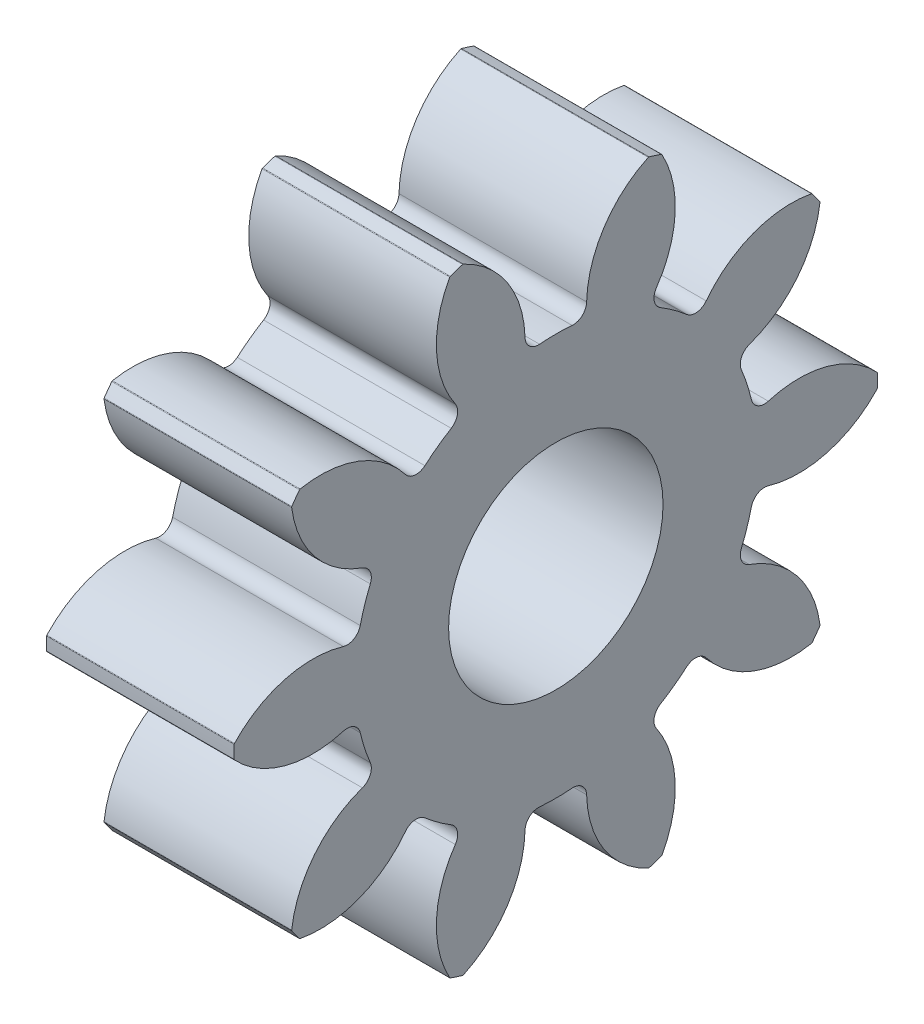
ISO-10303-21;
HEADER;
FILE_DESCRIPTION(('STEP AP214'),'2;1');
FILE_NAME('part.step','',(''),(''),'','','');
FILE_SCHEMA(('AUTOMOTIVE_DESIGN { 1 0 10303 214 1 1 1 1 }'));
ENDSEC;
DATA;
#1=APPLICATION_CONTEXT('core data for automotive mechanical design processes');
#2=APPLICATION_PROTOCOL_DEFINITION('international standard','automotive_design',2000,#1);
#3=PRODUCT_CONTEXT('',#1,'mechanical');
#4=PRODUCT('Part','Part','',(#3));
#5=PRODUCT_RELATED_PRODUCT_CATEGORY('part','',(#4));
#6=PRODUCT_DEFINITION_FORMATION('','',#4);
#7=PRODUCT_DEFINITION_CONTEXT('part definition',#1,'design');
#8=PRODUCT_DEFINITION('design','',#6,#7);
#9=PRODUCT_DEFINITION_SHAPE('','',#8);
#10=(LENGTH_UNIT() NAMED_UNIT(*) SI_UNIT(.MILLI.,.METRE.));
#11=(NAMED_UNIT(*) PLANE_ANGLE_UNIT() SI_UNIT($,.RADIAN.));
#12=(NAMED_UNIT(*) SI_UNIT($,.STERADIAN.) SOLID_ANGLE_UNIT());
#13=UNCERTAINTY_MEASURE_WITH_UNIT(LENGTH_MEASURE(1.E-05),#10,'distance_accuracy_value','');
#14=(GEOMETRIC_REPRESENTATION_CONTEXT(3) GLOBAL_UNCERTAINTY_ASSIGNED_CONTEXT((#13)) GLOBAL_UNIT_ASSIGNED_CONTEXT((#10,
#11,#12)) REPRESENTATION_CONTEXT('',''));
#15=CARTESIAN_POINT('',(0.,0.,0.));
#16=DIRECTION('',(0.,0.,1.));
#17=DIRECTION('',(1.,0.,0.));
#18=AXIS2_PLACEMENT_3D('',#15,#16,#17);
#19=CARTESIAN_POINT('',(7.,0.,0.));
#20=DIRECTION('',(-1.,0.,0.));
#21=DIRECTION('',(0.,0.,1.));
#22=AXIS2_PLACEMENT_3D('',#19,#20,#21);
#23=PLANE('',#22);
#24=CARTESIAN_POINT('',(7.,0.,0.));
#25=DIRECTION('',(-1.,0.,0.));
#26=DIRECTION('',(0.,0.,1.));
#27=AXIS2_PLACEMENT_3D('',#24,#25,#26);
#28=CIRCLE('',#27,4.);
#29=CARTESIAN_POINT('',(7.,0.,4.));
#30=VERTEX_POINT('',#29);
#31=EDGE_CURVE('E983',#30,#30,#28,.T.);
#32=ORIENTED_EDGE('',*,*,#31,.T.);
#33=EDGE_LOOP('',(#32));
#34=FACE_BOUND('',#33,.T.);
#35=CARTESIAN_POINT('',(7.,0.,0.));
#36=DIRECTION('',(-1.,0.,0.));
#37=DIRECTION('',(0.,0.,1.));
#38=AXIS2_PLACEMENT_3D('',#35,#36,#37);
#39=CIRCLE('',#38,12.);
#40=CARTESIAN_POINT('',(7.,7.24742959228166,-9.56424405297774));
#41=VERTEX_POINT('',#40);
#42=CARTESIAN_POINT('',(7.,6.85655772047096,-9.84822909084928));
#43=VERTEX_POINT('',#42);
#44=EDGE_CURVE('E1100',#41,#43,#39,.T.);
#45=ORIENTED_EDGE('',*,*,#44,.F.);
#46=CARTESIAN_POINT('',(7.,7.22327149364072,-9.53236323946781));
#47=DIRECTION('',(-1.,0.,0.));
#48=DIRECTION('',(0.,0.,1.));
#49=AXIS2_PLACEMENT_3D('',#46,#47,#48);
#50=CIRCLE('',#49,0.04);
#51=CARTESIAN_POINT('',(7.,7.26255356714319,-9.53990768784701));
#52=VERTEX_POINT('',#51);
#53=EDGE_CURVE('E798',#41,#52,#50,.F.);
#54=ORIENTED_EDGE('',*,*,#53,.T.);
#55=CARTESIAN_POINT('',(7.,3.33434621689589,-8.78546284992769));
#56=DIRECTION('',(-1.,0.,0.));
#57=DIRECTION('',(0.,-0.587785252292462,-0.809016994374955));
#58=AXIS2_PLACEMENT_3D('',#55,#56,#57);
#59=CIRCLE('',#58,4.);
#60=CARTESIAN_POINT('',(7.,5.76542168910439,-5.60900695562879));
#61=VERTEX_POINT('',#60);
#62=EDGE_CURVE('E969',#61,#52,#59,.T.);
#63=ORIENTED_EDGE('',*,*,#62,.F.);
#64=CARTESIAN_POINT('',(7.,6.06991389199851,-5.21115585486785));
#65=DIRECTION('',(-1.,0.,0.));
#66=DIRECTION('',(0.,0.,1.));
#67=AXIS2_PLACEMENT_3D('',#64,#65,#66);
#68=CIRCLE('',#67,0.501);
#69=CARTESIAN_POINT('',(7.,5.6897855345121,-4.88480721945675));
#70=VERTEX_POINT('',#69);
#71=EDGE_CURVE('E961',#61,#70,#68,.T.);
#72=ORIENTED_EDGE('',*,*,#71,.T.);
#73=CARTESIAN_POINT('',(7.,0.,0.));
#74=DIRECTION('',(-1.,0.,0.));
#75=DIRECTION('',(0.,-0.587785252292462,-0.809016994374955));
#76=AXIS2_PLACEMENT_3D('',#73,#74,#75);
#77=CIRCLE('',#76,7.499);
#78=CARTESIAN_POINT('',(7.,6.40396816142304,-3.9018191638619));
#79=VERTEX_POINT('',#78);
#80=EDGE_CURVE('E976',#79,#70,#77,.T.);
#81=ORIENTED_EDGE('',*,*,#80,.F.);
#82=CARTESIAN_POINT('',(7.,6.83181028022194,-4.16249544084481));
#83=DIRECTION('',(-1.,0.,0.));
#84=DIRECTION('',(0.,0.,1.));
#85=AXIS2_PLACEMENT_3D('',#82,#83,#84);
#86=CIRCLE('',#85,0.501);
#87=CARTESIAN_POINT('',(7.,7.11609589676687,-3.74996339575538));
#88=VERTEX_POINT('',#87);
#89=EDGE_CURVE('E11',#79,#88,#86,.T.);
#90=ORIENTED_EDGE('',*,*,#89,.T.);
#91=CARTESIAN_POINT('',(7.,9.38584133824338,-0.456294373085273));
#92=DIRECTION('',(-1.,0.,0.));
#93=DIRECTION('',(0.,-0.587785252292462,-0.809016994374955));
#94=AXIS2_PLACEMENT_3D('',#91,#92,#93);
#95=CIRCLE('',#94,4.);
#96=CARTESIAN_POINT('',(7.,11.3172438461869,-3.95910529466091));
#97=VERTEX_POINT('',#96);
#98=EDGE_CURVE('E974',#97,#88,#95,.T.);
#99=ORIENTED_EDGE('',*,*,#98,.F.);
#100=CARTESIAN_POINT('',(7.,11.2979298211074,-3.92407718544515));
#101=DIRECTION('',(-1.,0.,0.));
#102=DIRECTION('',(0.,0.,1.));
#103=AXIS2_PLACEMENT_3D('',#100,#101,#102);
#104=CIRCLE('',#103,0.04);
#105=CARTESIAN_POINT('',(7.,11.3357155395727,-3.93720118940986));
#106=VERTEX_POINT('',#105);
#107=EDGE_CURVE('E796',#97,#106,#104,.F.);
#108=ORIENTED_EDGE('',*,*,#107,.T.);
#109=CARTESIAN_POINT('',(7.,11.485015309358,-3.47770374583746));
#110=VERTEX_POINT('',#109);
#111=EDGE_CURVE('E560',#110,#106,#39,.T.);
#112=ORIENTED_EDGE('',*,*,#111,.F.);
#113=CARTESIAN_POINT('',(7.,11.4467319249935,-3.466111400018));
#114=DIRECTION('',(-1.,0.,0.));
#115=DIRECTION('',(0.,0.,1.));
#116=AXIS2_PLACEMENT_3D('',#113,#114,#115);
#117=CIRCLE('',#116,0.04);
#118=CARTESIAN_POINT('',(7.,11.4829463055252,-3.44912556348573));
#119=VERTEX_POINT('',#118);
#120=EDGE_CURVE('E570',#110,#119,#117,.F.);
#121=ORIENTED_EDGE('',*,*,#120,.T.);
#122=CARTESIAN_POINT('',(7.,7.86150825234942,-5.14770921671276));
#123=DIRECTION('',(-1.,0.,0.));
#124=DIRECTION('',(0.,0.,-1.));
#125=AXIS2_PLACEMENT_3D('',#122,#123,#124);
#126=CIRCLE('',#125,4.);
#127=CARTESIAN_POINT('',(7.,7.96121569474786,-1.14895210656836));
#128=VERTEX_POINT('',#127);
#129=EDGE_CURVE('E554',#128,#119,#126,.T.);
#130=ORIENTED_EDGE('',*,*,#129,.F.);
#131=CARTESIAN_POINT('',(7.,7.97370405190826,-0.648107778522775));
#132=DIRECTION('',(-1.,0.,0.));
#133=DIRECTION('',(0.,0.,1.));
#134=AXIS2_PLACEMENT_3D('',#131,#132,#133);
#135=CIRCLE('',#134,0.501);
#136=CARTESIAN_POINT('',(7.,7.47435083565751,-0.607520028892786));
#137=VERTEX_POINT('',#136);
#138=EDGE_CURVE('E586',#128,#137,#135,.T.);
#139=ORIENTED_EDGE('',*,*,#138,.T.);
#140=CARTESIAN_POINT('',(7.,0.,0.));
#141=DIRECTION('',(-1.,0.,0.));
#142=DIRECTION('',(0.,0.,-1.));
#143=AXIS2_PLACEMENT_3D('',#140,#141,#142);
#144=CIRCLE('',#143,7.499);
#145=CARTESIAN_POINT('',(7.,7.47435083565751,0.607520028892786));
#146=VERTEX_POINT('',#145);
#147=EDGE_CURVE('E1091',#146,#137,#144,.T.);
#148=ORIENTED_EDGE('',*,*,#147,.F.);
#149=CARTESIAN_POINT('',(7.,7.97370405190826,0.648107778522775));
#150=DIRECTION('',(-1.,0.,0.));
#151=DIRECTION('',(0.,0.,1.));
#152=AXIS2_PLACEMENT_3D('',#149,#150,#151);
#153=CIRCLE('',#152,0.501);
#154=CARTESIAN_POINT('',(7.,7.96121569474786,1.14895210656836));
#155=VERTEX_POINT('',#154);
#156=EDGE_CURVE('E590',#146,#155,#153,.T.);
#157=ORIENTED_EDGE('',*,*,#156,.T.);
#158=CARTESIAN_POINT('',(7.,7.86150825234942,5.14770921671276));
#159=DIRECTION('',(-1.,0.,0.));
#160=DIRECTION('',(0.,0.,-1.));
#161=AXIS2_PLACEMENT_3D('',#158,#159,#160);
#162=CIRCLE('',#161,4.);
#163=CARTESIAN_POINT('',(7.,11.4829463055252,3.44912556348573));
#164=VERTEX_POINT('',#163);
#165=EDGE_CURVE('E1088',#164,#155,#162,.T.);
#166=ORIENTED_EDGE('',*,*,#165,.F.);
#167=CARTESIAN_POINT('',(7.,11.4467319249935,3.466111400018));
#168=DIRECTION('',(-1.,0.,0.));
#169=DIRECTION('',(0.,0.,1.));
#170=AXIS2_PLACEMENT_3D('',#167,#168,#169);
#171=CIRCLE('',#170,0.04);
#172=CARTESIAN_POINT('',(7.,11.485015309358,3.47770374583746));
#173=VERTEX_POINT('',#172);
#174=EDGE_CURVE('E567',#164,#173,#171,.F.);
#175=ORIENTED_EDGE('',*,*,#174,.T.);
#176=CARTESIAN_POINT('',(7.,11.3357155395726,3.93720118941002));
#177=VERTEX_POINT('',#176);
#178=EDGE_CURVE('E1097',#177,#173,#39,.T.);
#179=ORIENTED_EDGE('',*,*,#178,.F.);
#180=CARTESIAN_POINT('',(7.,11.2979298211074,3.92407718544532));
#181=DIRECTION('',(-1.,0.,0.));
#182=DIRECTION('',(0.,0.,1.));
#183=AXIS2_PLACEMENT_3D('',#180,#181,#182);
#184=CIRCLE('',#183,0.04);
#185=CARTESIAN_POINT('',(7.,11.3172438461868,3.95910529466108));
#186=VERTEX_POINT('',#185);
#187=EDGE_CURVE('E623',#177,#186,#184,.F.);
#188=ORIENTED_EDGE('',*,*,#187,.T.);
#189=CARTESIAN_POINT('',(7.,9.38584133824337,0.456294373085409));
#190=DIRECTION('',(-1.,0.,0.));
#191=DIRECTION('',(0.,0.587785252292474,-0.809016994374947));
#192=AXIS2_PLACEMENT_3D('',#189,#190,#191);
#193=CIRCLE('',#192,4.);
#194=CARTESIAN_POINT('',(7.,7.11609589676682,3.74996339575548));
#195=VERTEX_POINT('',#194);
#196=EDGE_CURVE('E1076',#195,#186,#193,.T.);
#197=ORIENTED_EDGE('',*,*,#196,.F.);
#198=CARTESIAN_POINT('',(7.,6.83181028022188,4.16249544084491));
#199=DIRECTION('',(-1.,0.,0.));
#200=DIRECTION('',(0.,0.,1.));
#201=AXIS2_PLACEMENT_3D('',#198,#199,#200);
#202=CIRCLE('',#201,0.501);
#203=CARTESIAN_POINT('',(7.,6.40396816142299,3.90181916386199));
#204=VERTEX_POINT('',#203);
#205=EDGE_CURVE('E818',#195,#204,#202,.T.);
#206=ORIENTED_EDGE('',*,*,#205,.T.);
#207=CARTESIAN_POINT('',(7.,0.,0.));
#208=DIRECTION('',(-1.,0.,0.));
#209=DIRECTION('',(0.,0.587785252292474,-0.809016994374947));
#210=AXIS2_PLACEMENT_3D('',#207,#208,#209);
#211=CIRCLE('',#210,7.499);
#212=CARTESIAN_POINT('',(7.,5.68978553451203,4.88480721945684));
#213=VERTEX_POINT('',#212);
#214=EDGE_CURVE('E540',#213,#204,#211,.T.);
#215=ORIENTED_EDGE('',*,*,#214,.F.);
#216=CARTESIAN_POINT('',(7.,6.06991389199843,5.21115585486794));
#217=DIRECTION('',(-1.,0.,0.));
#218=DIRECTION('',(0.,0.,1.));
#219=AXIS2_PLACEMENT_3D('',#216,#217,#218);
#220=CIRCLE('',#219,0.501);
#221=CARTESIAN_POINT('',(7.,5.76542168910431,5.60900695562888));
#222=VERTEX_POINT('',#221);
#223=EDGE_CURVE('E822',#213,#222,#220,.T.);
#224=ORIENTED_EDGE('',*,*,#223,.T.);
#225=CARTESIAN_POINT('',(7.,3.33434621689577,8.78546284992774));
#226=DIRECTION('',(-1.,0.,0.));
#227=DIRECTION('',(0.,0.587785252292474,-0.809016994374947));
#228=AXIS2_PLACEMENT_3D('',#225,#226,#227);
#229=CIRCLE('',#228,4.);
#230=CARTESIAN_POINT('',(7.,7.26255356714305,9.53990768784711));
#231=VERTEX_POINT('',#230);
#232=EDGE_CURVE('E1078',#231,#222,#229,.T.);
#233=ORIENTED_EDGE('',*,*,#232,.F.);
#234=CARTESIAN_POINT('',(7.,7.22327149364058,9.53236323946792));
#235=DIRECTION('',(-1.,0.,0.));
#236=DIRECTION('',(0.,0.,1.));
#237=AXIS2_PLACEMENT_3D('',#234,#235,#236);
#238=CIRCLE('',#237,0.04);
#239=CARTESIAN_POINT('',(7.,7.24742959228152,9.56424405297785));
#240=VERTEX_POINT('',#239);
#241=EDGE_CURVE('E620',#231,#240,#238,.F.);
#242=ORIENTED_EDGE('',*,*,#241,.T.);
#243=CARTESIAN_POINT('',(7.,6.85655772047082,9.84822909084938));
#244=VERTEX_POINT('',#243);
#245=EDGE_CURVE('E1105',#244,#240,#39,.T.);
#246=ORIENTED_EDGE('',*,*,#245,.F.);
#247=CARTESIAN_POINT('',(7.,6.83370252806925,9.81540166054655));
#248=DIRECTION('',(-1.,0.,0.));
#249=DIRECTION('',(0.,0.,1.));
#250=AXIS2_PLACEMENT_3D('',#247,#248,#249);
#251=CIRCLE('',#250,0.04);
#252=CARTESIAN_POINT('',(7.,6.82873889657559,9.85509249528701));
#253=VERTEX_POINT('',#252);
#254=EDGE_CURVE('E645',#244,#253,#251,.F.);
#255=ORIENTED_EDGE('',*,*,#254,.T.);
#256=CARTESIAN_POINT('',(7.,7.32510204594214,5.88600902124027));
#257=DIRECTION('',(-1.,0.,0.));
#258=DIRECTION('',(0.,0.951056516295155,-0.309016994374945));
#259=AXIS2_PLACEMENT_3D('',#256,#257,#258);
#260=CIRCLE('',#259,4.);
#261=CARTESIAN_POINT('',(7.,3.55286933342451,7.21652033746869));
#262=VERTEX_POINT('',#261);
#263=EDGE_CURVE('E1063',#262,#253,#260,.T.);
#264=ORIENTED_EDGE('',*,*,#263,.F.);
#265=CARTESIAN_POINT('',(7.,3.08039718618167,7.3831668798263));
#266=DIRECTION('',(-1.,0.,0.));
#267=DIRECTION('',(0.,0.,1.));
#268=AXIS2_PLACEMENT_3D('',#265,#266,#267);
#269=CIRCLE('',#268,0.501);
#270=CARTESIAN_POINT('',(7.,2.88748731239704,6.92079605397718));
#271=VERTEX_POINT('',#270);
#272=EDGE_CURVE('E836',#262,#271,#269,.T.);
#273=ORIENTED_EDGE('',*,*,#272,.T.);
#274=CARTESIAN_POINT('',(7.,0.,0.));
#275=DIRECTION('',(-1.,0.,0.));
#276=DIRECTION('',(0.,0.951056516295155,-0.309016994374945));
#277=AXIS2_PLACEMENT_3D('',#274,#275,#276);
#278=CIRCLE('',#277,7.499);
#279=CARTESIAN_POINT('',(7.,1.73191554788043,7.29626408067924));
#280=VERTEX_POINT('',#279);
#281=EDGE_CURVE('E1069',#280,#271,#278,.T.);
#282=ORIENTED_EDGE('',*,*,#281,.F.);
#283=CARTESIAN_POINT('',(7.,1.84762293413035,7.78371951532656));
#284=DIRECTION('',(-1.,0.,0.));
#285=DIRECTION('',(0.,0.,1.));
#286=AXIS2_PLACEMENT_3D('',#283,#284,#285);
#287=CIRCLE('',#286,0.501);
#288=CARTESIAN_POINT('',(7.,1.36743255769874,7.92661179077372));
#289=VERTEX_POINT('',#288);
#290=EDGE_CURVE('E840',#280,#289,#287,.T.);
#291=ORIENTED_EDGE('',*,*,#290,.T.);
#292=CARTESIAN_POINT('',(7.,-2.46642274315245,9.06746828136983));
#293=DIRECTION('',(-1.,0.,0.));
#294=DIRECTION('',(0.,0.951056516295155,-0.309016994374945));
#295=AXIS2_PLACEMENT_3D('',#292,#293,#294);
#296=CIRCLE('',#295,4.);
#297=CARTESIAN_POINT('',(7.,0.26811221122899,11.9867693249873));
#298=VERTEX_POINT('',#297);
#299=EDGE_CURVE('E1065',#298,#289,#296,.T.);
#300=ORIENTED_EDGE('',*,*,#299,.F.);
#301=CARTESIAN_POINT('',(7.,0.240766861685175,11.9575763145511));
#302=DIRECTION('',(-1.,0.,0.));
#303=DIRECTION('',(0.,0.,1.));
#304=AXIS2_PLACEMENT_3D('',#301,#302,#303);
#305=CIRCLE('',#304,0.04);
#306=CARTESIAN_POINT('',(7.,0.24157210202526,11.9975682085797));
#307=VERTEX_POINT('',#306);
#308=EDGE_CURVE('E642',#298,#307,#305,.F.);
#309=ORIENTED_EDGE('',*,*,#308,.T.);
#310=CARTESIAN_POINT('',(7.,-0.241572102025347,11.9975682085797));
#311=VERTEX_POINT('',#310);
#312=EDGE_CURVE('E1108',#311,#307,#39,.T.);
#313=ORIENTED_EDGE('',*,*,#312,.F.);
#314=CARTESIAN_POINT('',(7.,-0.240766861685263,11.9575763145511));
#315=DIRECTION('',(-1.,0.,0.));
#316=DIRECTION('',(0.,0.,1.));
#317=AXIS2_PLACEMENT_3D('',#314,#315,#316);
#318=CIRCLE('',#317,0.04);
#319=CARTESIAN_POINT('',(7.,-0.268112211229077,11.9867693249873));
#320=VERTEX_POINT('',#319);
#321=EDGE_CURVE('E667',#311,#320,#318,.F.);
#322=ORIENTED_EDGE('',*,*,#321,.T.);
#323=CARTESIAN_POINT('',(7.,2.46642274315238,9.06746828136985));
#324=DIRECTION('',(-1.,0.,0.));
#325=DIRECTION('',(0.,0.951056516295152,0.309016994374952));
#326=AXIS2_PLACEMENT_3D('',#323,#324,#325);
#327=CIRCLE('',#326,4.);
#328=CARTESIAN_POINT('',(7.,-1.36743255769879,7.92661179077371));
#329=VERTEX_POINT('',#328);
#330=EDGE_CURVE('E1050',#329,#320,#327,.T.);
#331=ORIENTED_EDGE('',*,*,#330,.F.);
#332=CARTESIAN_POINT('',(7.,-1.8476229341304,7.78371951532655));
#333=DIRECTION('',(-1.,0.,0.));
#334=DIRECTION('',(0.,0.,1.));
#335=AXIS2_PLACEMENT_3D('',#332,#333,#334);
#336=CIRCLE('',#335,0.501);
#337=CARTESIAN_POINT('',(7.,-1.73191554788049,7.29626408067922));
#338=VERTEX_POINT('',#337);
#339=EDGE_CURVE('E854',#329,#338,#336,.T.);
#340=ORIENTED_EDGE('',*,*,#339,.T.);
#341=CARTESIAN_POINT('',(7.,0.,0.));
#342=DIRECTION('',(-1.,0.,0.));
#343=DIRECTION('',(0.,0.951056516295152,0.309016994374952));
#344=AXIS2_PLACEMENT_3D('',#341,#342,#343);
#345=CIRCLE('',#344,7.499);
#346=CARTESIAN_POINT('',(7.,-2.88748731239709,6.92079605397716));
#347=VERTEX_POINT('',#346);
#348=EDGE_CURVE('E1056',#347,#338,#345,.T.);
#349=ORIENTED_EDGE('',*,*,#348,.F.);
#350=CARTESIAN_POINT('',(7.,-3.08039718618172,7.38316687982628));
#351=DIRECTION('',(-1.,0.,0.));
#352=DIRECTION('',(0.,0.,1.));
#353=AXIS2_PLACEMENT_3D('',#350,#351,#352);
#354=CIRCLE('',#353,0.501);
#355=CARTESIAN_POINT('',(7.,-3.55286933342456,7.21652033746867));
#356=VERTEX_POINT('',#355);
#357=EDGE_CURVE('E858',#347,#356,#354,.T.);
#358=ORIENTED_EDGE('',*,*,#357,.T.);
#359=CARTESIAN_POINT('',(7.,-7.32510204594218,5.88600902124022));
#360=DIRECTION('',(-1.,0.,0.));
#361=DIRECTION('',(0.,0.951056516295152,0.309016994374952));
#362=AXIS2_PLACEMENT_3D('',#359,#360,#361);
#363=CIRCLE('',#362,4.);
#364=CARTESIAN_POINT('',(7.,-6.82873889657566,9.85509249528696));
#365=VERTEX_POINT('',#364);
#366=EDGE_CURVE('E1052',#365,#356,#363,.T.);
#367=ORIENTED_EDGE('',*,*,#366,.F.);
#368=CARTESIAN_POINT('',(7.,-6.83370252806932,9.8154016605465));
#369=DIRECTION('',(-1.,0.,0.));
#370=DIRECTION('',(0.,0.,1.));
#371=AXIS2_PLACEMENT_3D('',#368,#369,#370);
#372=CIRCLE('',#371,0.04);
#373=CARTESIAN_POINT('',(7.,-6.85655772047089,9.84822909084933));
#374=VERTEX_POINT('',#373);
#375=EDGE_CURVE('E664',#365,#374,#372,.F.);
#376=ORIENTED_EDGE('',*,*,#375,.T.);
#377=CARTESIAN_POINT('',(7.,-7.24742959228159,9.5642440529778));
#378=VERTEX_POINT('',#377);
#379=EDGE_CURVE('E1111',#378,#374,#39,.T.);
#380=ORIENTED_EDGE('',*,*,#379,.F.);
#381=CARTESIAN_POINT('',(7.,-7.22327149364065,9.53236323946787));
#382=DIRECTION('',(-1.,0.,0.));
#383=DIRECTION('',(0.,0.,1.));
#384=AXIS2_PLACEMENT_3D('',#381,#382,#383);
#385=CIRCLE('',#384,0.04);
#386=CARTESIAN_POINT('',(7.,-7.26255356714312,9.53990768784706));
#387=VERTEX_POINT('',#386);
#388=EDGE_CURVE('E689',#378,#387,#385,.F.);
#389=ORIENTED_EDGE('',*,*,#388,.T.);
#390=CARTESIAN_POINT('',(7.,-3.33434621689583,8.78546284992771));
#391=DIRECTION('',(-1.,0.,0.));
#392=DIRECTION('',(0.,0.587785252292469,0.809016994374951));
#393=AXIS2_PLACEMENT_3D('',#390,#391,#392);
#394=CIRCLE('',#393,4.);
#395=CARTESIAN_POINT('',(7.,-5.76542168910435,5.60900695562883));
#396=VERTEX_POINT('',#395);
#397=EDGE_CURVE('E1037',#396,#387,#394,.T.);
#398=ORIENTED_EDGE('',*,*,#397,.F.);
#399=CARTESIAN_POINT('',(7.,-6.06991389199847,5.2111558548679));
#400=DIRECTION('',(-1.,0.,0.));
#401=DIRECTION('',(0.,0.,1.));
#402=AXIS2_PLACEMENT_3D('',#399,#400,#401);
#403=CIRCLE('',#402,0.501);
#404=CARTESIAN_POINT('',(7.,-5.68978553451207,4.8848072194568));
#405=VERTEX_POINT('',#404);
#406=EDGE_CURVE('E872',#396,#405,#403,.T.);
#407=ORIENTED_EDGE('',*,*,#406,.T.);
#408=CARTESIAN_POINT('',(7.,0.,0.));
#409=DIRECTION('',(-1.,0.,0.));
#410=DIRECTION('',(0.,0.587785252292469,0.809016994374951));
#411=AXIS2_PLACEMENT_3D('',#408,#409,#410);
#412=CIRCLE('',#411,7.499);
#413=CARTESIAN_POINT('',(7.,-6.40396816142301,3.90181916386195));
#414=VERTEX_POINT('',#413);
#415=EDGE_CURVE('E1043',#414,#405,#412,.T.);
#416=ORIENTED_EDGE('',*,*,#415,.F.);
#417=CARTESIAN_POINT('',(7.,-6.83181028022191,4.16249544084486));
#418=DIRECTION('',(-1.,0.,0.));
#419=DIRECTION('',(0.,0.,1.));
#420=AXIS2_PLACEMENT_3D('',#417,#418,#419);
#421=CIRCLE('',#420,0.501);
#422=CARTESIAN_POINT('',(7.,-7.11609589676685,3.74996339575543));
#423=VERTEX_POINT('',#422);
#424=EDGE_CURVE('E876',#414,#423,#421,.T.);
#425=ORIENTED_EDGE('',*,*,#424,.T.);
#426=CARTESIAN_POINT('',(7.,-9.38584133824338,0.456294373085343));
#427=DIRECTION('',(-1.,0.,0.));
#428=DIRECTION('',(0.,0.587785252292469,0.809016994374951));
#429=AXIS2_PLACEMENT_3D('',#426,#427,#428);
#430=CIRCLE('',#429,4.);
#431=CARTESIAN_POINT('',(7.,-11.3172438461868,3.959105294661));
#432=VERTEX_POINT('',#431);
#433=EDGE_CURVE('E1039',#432,#423,#430,.T.);
#434=ORIENTED_EDGE('',*,*,#433,.F.);
#435=CARTESIAN_POINT('',(7.,-11.2979298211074,3.92407718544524));
#436=DIRECTION('',(-1.,0.,0.));
#437=DIRECTION('',(0.,0.,1.));
#438=AXIS2_PLACEMENT_3D('',#435,#436,#437);
#439=CIRCLE('',#438,0.04);
#440=CARTESIAN_POINT('',(7.,-11.3357155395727,3.93720118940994));
#441=VERTEX_POINT('',#440);
#442=EDGE_CURVE('E686',#432,#441,#439,.F.);
#443=ORIENTED_EDGE('',*,*,#442,.T.);
#444=CARTESIAN_POINT('',(7.,-11.485015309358,3.47770374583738));
#445=VERTEX_POINT('',#444);
#446=EDGE_CURVE('E1114',#445,#441,#39,.T.);
#447=ORIENTED_EDGE('',*,*,#446,.F.);
#448=CARTESIAN_POINT('',(7.,-11.4467319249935,3.46611140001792));
#449=DIRECTION('',(-1.,0.,0.));
#450=DIRECTION('',(0.,0.,1.));
#451=AXIS2_PLACEMENT_3D('',#448,#449,#450);
#452=CIRCLE('',#451,0.04);
#453=CARTESIAN_POINT('',(7.,-11.4829463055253,3.44912556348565));
#454=VERTEX_POINT('',#453);
#455=EDGE_CURVE('E711',#445,#454,#452,.F.);
#456=ORIENTED_EDGE('',*,*,#455,.T.);
#457=CARTESIAN_POINT('',(7.,-7.86150825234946,5.1477092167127));
#458=DIRECTION('',(-1.,0.,0.));
#459=DIRECTION('',(0.,0.,1.));
#460=AXIS2_PLACEMENT_3D('',#457,#458,#459);
#461=CIRCLE('',#460,4.);
#462=CARTESIAN_POINT('',(7.,-7.96121569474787,1.1489521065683));
#463=VERTEX_POINT('',#462);
#464=EDGE_CURVE('E1024',#463,#454,#461,.T.);
#465=ORIENTED_EDGE('',*,*,#464,.F.);
#466=CARTESIAN_POINT('',(7.,-7.97370405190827,0.648107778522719));
#467=DIRECTION('',(-1.,0.,0.));
#468=DIRECTION('',(0.,0.,1.));
#469=AXIS2_PLACEMENT_3D('',#466,#467,#468);
#470=CIRCLE('',#469,0.501);
#471=CARTESIAN_POINT('',(7.,-7.47435083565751,0.607520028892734));
#472=VERTEX_POINT('',#471);
#473=EDGE_CURVE('E890',#463,#472,#470,.T.);
#474=ORIENTED_EDGE('',*,*,#473,.T.);
#475=CARTESIAN_POINT('',(7.,0.,0.));
#476=DIRECTION('',(-1.,0.,0.));
#477=DIRECTION('',(0.,0.,1.));
#478=AXIS2_PLACEMENT_3D('',#475,#476,#477);
#479=CIRCLE('',#478,7.499);
#480=CARTESIAN_POINT('',(7.,-7.4743508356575,-0.607520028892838));
#481=VERTEX_POINT('',#480);
#482=EDGE_CURVE('E1030',#481,#472,#479,.T.);
#483=ORIENTED_EDGE('',*,*,#482,.F.);
#484=CARTESIAN_POINT('',(7.,-7.97370405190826,-0.64810777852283));
#485=DIRECTION('',(-1.,0.,0.));
#486=DIRECTION('',(0.,0.,1.));
#487=AXIS2_PLACEMENT_3D('',#484,#485,#486);
#488=CIRCLE('',#487,0.501);
#489=CARTESIAN_POINT('',(7.,-7.96121569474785,-1.14895210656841));
#490=VERTEX_POINT('',#489);
#491=EDGE_CURVE('E894',#481,#490,#488,.T.);
#492=ORIENTED_EDGE('',*,*,#491,.T.);
#493=CARTESIAN_POINT('',(7.,-7.86150825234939,-5.14770921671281));
#494=DIRECTION('',(-1.,0.,0.));
#495=DIRECTION('',(0.,0.,1.));
#496=AXIS2_PLACEMENT_3D('',#493,#494,#495);
#497=CIRCLE('',#496,4.);
#498=CARTESIAN_POINT('',(7.,-11.4829463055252,-3.44912556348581));
#499=VERTEX_POINT('',#498);
#500=EDGE_CURVE('E1026',#499,#490,#497,.T.);
#501=ORIENTED_EDGE('',*,*,#500,.F.);
#502=CARTESIAN_POINT('',(7.,-11.4467319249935,-3.46611140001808));
#503=DIRECTION('',(-1.,0.,0.));
#504=DIRECTION('',(0.,0.,1.));
#505=AXIS2_PLACEMENT_3D('',#502,#503,#504);
#506=CIRCLE('',#505,0.04);
#507=CARTESIAN_POINT('',(7.,-11.485015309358,-3.47770374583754));
#508=VERTEX_POINT('',#507);
#509=EDGE_CURVE('E708',#499,#508,#506,.F.);
#510=ORIENTED_EDGE('',*,*,#509,.T.);
#511=CARTESIAN_POINT('',(7.,-11.3357155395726,-3.9372011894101));
#512=VERTEX_POINT('',#511);
#513=EDGE_CURVE('E1117',#512,#508,#39,.T.);
#514=ORIENTED_EDGE('',*,*,#513,.F.);
#515=CARTESIAN_POINT('',(7.,-11.2979298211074,-3.9240771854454));
#516=DIRECTION('',(-1.,0.,0.));
#517=DIRECTION('',(0.,0.,1.));
#518=AXIS2_PLACEMENT_3D('',#515,#516,#517);
#519=CIRCLE('',#518,0.04);
#520=CARTESIAN_POINT('',(7.,-11.3172438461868,-3.95910529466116));
#521=VERTEX_POINT('',#520);
#522=EDGE_CURVE('E733',#512,#521,#519,.F.);
#523=ORIENTED_EDGE('',*,*,#522,.T.);
#524=CARTESIAN_POINT('',(7.,-9.38584133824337,-0.456294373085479));
#525=DIRECTION('',(-1.,0.,0.));
#526=DIRECTION('',(0.,-0.58778525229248,0.809016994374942));
#527=AXIS2_PLACEMENT_3D('',#524,#525,#526);
#528=CIRCLE('',#527,4.);
#529=CARTESIAN_POINT('',(7.,-7.11609589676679,-3.74996339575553));
#530=VERTEX_POINT('',#529);
#531=EDGE_CURVE('E1011',#530,#521,#528,.T.);
#532=ORIENTED_EDGE('',*,*,#531,.F.);
#533=CARTESIAN_POINT('',(7.,-6.83181028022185,-4.16249544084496));
#534=DIRECTION('',(-1.,0.,0.));
#535=DIRECTION('',(0.,0.,1.));
#536=AXIS2_PLACEMENT_3D('',#533,#534,#535);
#537=CIRCLE('',#536,0.501);
#538=CARTESIAN_POINT('',(7.,-6.40396816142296,-3.90181916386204));
#539=VERTEX_POINT('',#538);
#540=EDGE_CURVE('E908',#530,#539,#537,.T.);
#541=ORIENTED_EDGE('',*,*,#540,.T.);
#542=CARTESIAN_POINT('',(7.,0.,0.));
#543=DIRECTION('',(-1.,0.,0.));
#544=DIRECTION('',(0.,-0.58778525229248,0.809016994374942));
#545=AXIS2_PLACEMENT_3D('',#542,#543,#544);
#546=CIRCLE('',#545,7.499);
#547=CARTESIAN_POINT('',(7.,-5.689785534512,-4.88480721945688));
#548=VERTEX_POINT('',#547);
#549=EDGE_CURVE('E1017',#548,#539,#546,.T.);
#550=ORIENTED_EDGE('',*,*,#549,.F.);
#551=CARTESIAN_POINT('',(7.,-6.0699138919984,-5.21115585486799));
#552=DIRECTION('',(-1.,0.,0.));
#553=DIRECTION('',(0.,0.,1.));
#554=AXIS2_PLACEMENT_3D('',#551,#552,#553);
#555=CIRCLE('',#554,0.501);
#556=CARTESIAN_POINT('',(7.,-5.76542168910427,-5.60900695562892));
#557=VERTEX_POINT('',#556);
#558=EDGE_CURVE('E912',#548,#557,#555,.T.);
#559=ORIENTED_EDGE('',*,*,#558,.T.);
#560=CARTESIAN_POINT('',(7.,-3.3343462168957,-8.78546284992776));
#561=DIRECTION('',(-1.,0.,0.));
#562=DIRECTION('',(0.,-0.58778525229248,0.809016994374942));
#563=AXIS2_PLACEMENT_3D('',#560,#561,#562);
#564=CIRCLE('',#563,4.);
#565=CARTESIAN_POINT('',(7.,-7.26255356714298,-9.53990768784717));
#566=VERTEX_POINT('',#565);
#567=EDGE_CURVE('E1013',#566,#557,#564,.T.);
#568=ORIENTED_EDGE('',*,*,#567,.F.);
#569=CARTESIAN_POINT('',(7.,-7.22327149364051,-9.53236323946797));
#570=DIRECTION('',(-1.,0.,0.));
#571=DIRECTION('',(0.,0.,1.));
#572=AXIS2_PLACEMENT_3D('',#569,#570,#571);
#573=CIRCLE('',#572,0.04);
#574=CARTESIAN_POINT('',(7.,-7.24742959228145,-9.5642440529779));
#575=VERTEX_POINT('',#574);
#576=EDGE_CURVE('E730',#566,#575,#573,.F.);
#577=ORIENTED_EDGE('',*,*,#576,.T.);
#578=CARTESIAN_POINT('',(7.,-6.85655772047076,-9.84822909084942));
#579=VERTEX_POINT('',#578);
#580=EDGE_CURVE('E1120',#579,#575,#39,.T.);
#581=ORIENTED_EDGE('',*,*,#580,.F.);
#582=CARTESIAN_POINT('',(7.,-6.83370252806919,-9.81540166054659));
#583=DIRECTION('',(-1.,0.,0.));
#584=DIRECTION('',(0.,0.,1.));
#585=AXIS2_PLACEMENT_3D('',#582,#583,#584);
#586=CIRCLE('',#585,0.04);
#587=CARTESIAN_POINT('',(7.,-6.82873889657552,-9.85509249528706));
#588=VERTEX_POINT('',#587);
#589=EDGE_CURVE('E755',#579,#588,#586,.F.);
#590=ORIENTED_EDGE('',*,*,#589,.T.);
#591=CARTESIAN_POINT('',(7.,-7.32510204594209,-5.88600902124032));
#592=DIRECTION('',(-1.,0.,0.));
#593=DIRECTION('',(0.,-0.951056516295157,0.309016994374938));
#594=AXIS2_PLACEMENT_3D('',#591,#592,#593);
#595=CIRCLE('',#594,4.);
#596=CARTESIAN_POINT('',(7.,-3.55286933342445,-7.21652033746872));
#597=VERTEX_POINT('',#596);
#598=EDGE_CURVE('E998',#597,#588,#595,.T.);
#599=ORIENTED_EDGE('',*,*,#598,.F.);
#600=CARTESIAN_POINT('',(7.,-3.08039718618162,-7.38316687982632));
#601=DIRECTION('',(-1.,0.,0.));
#602=DIRECTION('',(0.,0.,1.));
#603=AXIS2_PLACEMENT_3D('',#600,#601,#602);
#604=CIRCLE('',#603,0.501);
#605=CARTESIAN_POINT('',(7.,-2.887487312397,-6.9207960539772));
#606=VERTEX_POINT('',#605);
#607=EDGE_CURVE('E926',#597,#606,#604,.T.);
#608=ORIENTED_EDGE('',*,*,#607,.T.);
#609=CARTESIAN_POINT('',(7.,0.,0.));
#610=DIRECTION('',(-1.,0.,0.));
#611=DIRECTION('',(0.,-0.951056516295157,0.309016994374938));
#612=AXIS2_PLACEMENT_3D('',#609,#610,#611);
#613=CIRCLE('',#612,7.499);
#614=CARTESIAN_POINT('',(7.,-1.73191554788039,-7.29626408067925));
#615=VERTEX_POINT('',#614);
#616=EDGE_CURVE('E1004',#615,#606,#613,.T.);
#617=ORIENTED_EDGE('',*,*,#616,.F.);
#618=CARTESIAN_POINT('',(7.,-1.8476229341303,-7.78371951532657));
#619=DIRECTION('',(-1.,0.,0.));
#620=DIRECTION('',(0.,0.,1.));
#621=AXIS2_PLACEMENT_3D('',#618,#619,#620);
#622=CIRCLE('',#621,0.501);
#623=CARTESIAN_POINT('',(7.,-1.36743255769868,-7.92661179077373));
#624=VERTEX_POINT('',#623);
#625=EDGE_CURVE('E930',#615,#624,#622,.T.);
#626=ORIENTED_EDGE('',*,*,#625,.T.);
#627=CARTESIAN_POINT('',(7.,2.46642274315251,-9.06746828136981));
#628=DIRECTION('',(-1.,0.,0.));
#629=DIRECTION('',(0.,-0.951056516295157,0.309016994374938));
#630=AXIS2_PLACEMENT_3D('',#627,#628,#629);
#631=CIRCLE('',#630,4.);
#632=CARTESIAN_POINT('',(7.,-0.268112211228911,-11.9867693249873));
#633=VERTEX_POINT('',#632);
#634=EDGE_CURVE('E1000',#633,#624,#631,.T.);
#635=ORIENTED_EDGE('',*,*,#634,.F.);
#636=CARTESIAN_POINT('',(7.,-0.240766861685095,-11.9575763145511));
#637=DIRECTION('',(-1.,0.,0.));
#638=DIRECTION('',(0.,0.,1.));
#639=AXIS2_PLACEMENT_3D('',#636,#637,#638);
#640=CIRCLE('',#639,0.04);
#641=CARTESIAN_POINT('',(7.,-0.241572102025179,-11.9975682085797));
#642=VERTEX_POINT('',#641);
#643=EDGE_CURVE('E752',#633,#642,#640,.F.);
#644=ORIENTED_EDGE('',*,*,#643,.T.);
#645=CARTESIAN_POINT('',(7.,0.24157210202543,-11.9975682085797));
#646=VERTEX_POINT('',#645);
#647=EDGE_CURVE('E1104',#646,#642,#39,.T.);
#648=ORIENTED_EDGE('',*,*,#647,.F.);
#649=CARTESIAN_POINT('',(7.,0.240766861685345,-11.9575763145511));
#650=DIRECTION('',(-1.,0.,0.));
#651=DIRECTION('',(0.,0.,1.));
#652=AXIS2_PLACEMENT_3D('',#649,#650,#651);
#653=CIRCLE('',#652,0.04);
#654=CARTESIAN_POINT('',(7.,0.26811221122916,-11.9867693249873));
#655=VERTEX_POINT('',#654);
#656=EDGE_CURVE('E777',#646,#655,#653,.F.);
#657=ORIENTED_EDGE('',*,*,#656,.T.);
#658=CARTESIAN_POINT('',(7.,-2.46642274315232,-9.06746828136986));
#659=DIRECTION('',(-1.,0.,0.));
#660=DIRECTION('',(0.,-0.95105651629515,-0.309016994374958));
#661=AXIS2_PLACEMENT_3D('',#658,#659,#660);
#662=CIRCLE('',#661,4.);
#663=CARTESIAN_POINT('',(7.,1.36743255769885,-7.9266117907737));
#664=VERTEX_POINT('',#663);
#665=EDGE_CURVE('E985',#664,#655,#662,.T.);
#666=ORIENTED_EDGE('',*,*,#665,.F.);
#667=CARTESIAN_POINT('',(7.,1.84762293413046,-7.78371951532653));
#668=DIRECTION('',(-1.,0.,0.));
#669=DIRECTION('',(0.,0.,1.));
#670=AXIS2_PLACEMENT_3D('',#667,#668,#669);
#671=CIRCLE('',#670,0.501);
#672=CARTESIAN_POINT('',(7.,1.73191554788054,-7.29626408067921));
#673=VERTEX_POINT('',#672);
#674=EDGE_CURVE('E944',#664,#673,#671,.T.);
#675=ORIENTED_EDGE('',*,*,#674,.T.);
#676=CARTESIAN_POINT('',(7.,0.,0.));
#677=DIRECTION('',(-1.,0.,0.));
#678=DIRECTION('',(0.,-0.95105651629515,-0.309016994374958));
#679=AXIS2_PLACEMENT_3D('',#676,#677,#678);
#680=CIRCLE('',#679,7.499);
#681=CARTESIAN_POINT('',(7.,2.88748731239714,-6.92079605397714));
#682=VERTEX_POINT('',#681);
#683=EDGE_CURVE('E991',#682,#673,#680,.T.);
#684=ORIENTED_EDGE('',*,*,#683,.F.);
#685=CARTESIAN_POINT('',(7.,3.08039718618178,-7.38316687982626));
#686=DIRECTION('',(-1.,0.,0.));
#687=DIRECTION('',(0.,0.,1.));
#688=AXIS2_PLACEMENT_3D('',#685,#686,#687);
#689=CIRCLE('',#688,0.501);
#690=CARTESIAN_POINT('',(7.,3.55286933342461,-7.21652033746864));
#691=VERTEX_POINT('',#690);
#692=EDGE_CURVE('E948',#682,#691,#689,.T.);
#693=ORIENTED_EDGE('',*,*,#692,.T.);
#694=CARTESIAN_POINT('',(7.,7.32510204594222,-5.88600902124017));
#695=DIRECTION('',(-1.,0.,0.));
#696=DIRECTION('',(0.,-0.95105651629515,-0.309016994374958));
#697=AXIS2_PLACEMENT_3D('',#694,#695,#696);
#698=CIRCLE('',#697,4.);
#699=CARTESIAN_POINT('',(7.,6.82873889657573,-9.85509249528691));
#700=VERTEX_POINT('',#699);
#701=EDGE_CURVE('E987',#700,#691,#698,.T.);
#702=ORIENTED_EDGE('',*,*,#701,.F.);
#703=CARTESIAN_POINT('',(7.,6.83370252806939,-9.81540166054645));
#704=DIRECTION('',(-1.,0.,0.));
#705=DIRECTION('',(0.,0.,1.));
#706=AXIS2_PLACEMENT_3D('',#703,#704,#705);
#707=CIRCLE('',#706,0.04);
#708=EDGE_CURVE('E774',#700,#43,#707,.F.);
#709=ORIENTED_EDGE('',*,*,#708,.T.);
#710=EDGE_LOOP('',(#45,#54,#63,#72,#81,#90,#99,#108,#112,#121,#130,#139,#148,#157,#166,#175,
#179,#188,#197,#206,#215,#224,#233,#242,#246,#255,#264,#273,#282,#291,#300,#309,#313,#322,#331,
#340,#349,#358,#367,#376,#380,#389,#398,#407,#416,#425,#434,#443,#447,#456,#465,#474,#483,#492,
#501,#510,#514,#523,#532,#541,#550,#559,#568,#577,#581,#590,#599,#608,#617,#626,#635,#644,#648,
#657,#666,#675,#684,#693,#702,#709));
#711=FACE_BOUND('',#710,.T.);
#712=ADVANCED_FACE('F31',(#34,#711),#23,.F.);
#713=CARTESIAN_POINT('',(0.,0.,0.));
#714=DIRECTION('',(1.,0.,0.));
#715=DIRECTION('',(0.,0.,-1.));
#716=AXIS2_PLACEMENT_3D('',#713,#714,#715);
#717=PLANE('',#716);
#718=CARTESIAN_POINT('',(0.,0.,0.));
#719=DIRECTION('',(-1.,0.,0.));
#720=DIRECTION('',(0.,0.,1.));
#721=AXIS2_PLACEMENT_3D('',#718,#719,#720);
#722=CIRCLE('',#721,4.);
#723=CARTESIAN_POINT('',(0.,0.,4.));
#724=VERTEX_POINT('',#723);
#725=EDGE_CURVE('E2052',#724,#724,#722,.T.);
#726=ORIENTED_EDGE('',*,*,#725,.F.);
#727=EDGE_LOOP('',(#726));
#728=FACE_BOUND('',#727,.T.);
#729=CARTESIAN_POINT('',(0.,0.,0.));
#730=DIRECTION('',(-1.,0.,0.));
#731=DIRECTION('',(0.,-0.587785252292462,-0.809016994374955));
#732=AXIS2_PLACEMENT_3D('',#729,#730,#731);
#733=CIRCLE('',#732,7.499);
#734=CARTESIAN_POINT('',(0.,6.40396816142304,-3.9018191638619));
#735=VERTEX_POINT('',#734);
#736=CARTESIAN_POINT('',(0.,5.6897855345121,-4.88480721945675));
#737=VERTEX_POINT('',#736);
#738=EDGE_CURVE('E964',#735,#737,#733,.T.);
#739=ORIENTED_EDGE('',*,*,#738,.T.);
#740=CARTESIAN_POINT('',(0.,6.06991389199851,-5.21115585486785));
#741=DIRECTION('',(1.,0.,0.));
#742=DIRECTION('',(0.,0.,-1.));
#743=AXIS2_PLACEMENT_3D('',#740,#741,#742);
#744=CIRCLE('',#743,0.501);
#745=CARTESIAN_POINT('',(0.,5.76542168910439,-5.60900695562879));
#746=VERTEX_POINT('',#745);
#747=EDGE_CURVE('E959',#737,#746,#744,.T.);
#748=ORIENTED_EDGE('',*,*,#747,.T.);
#749=CARTESIAN_POINT('',(0.,3.33434621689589,-8.78546284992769));
#750=DIRECTION('',(-1.,0.,0.));
#751=DIRECTION('',(0.,-0.587785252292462,-0.809016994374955));
#752=AXIS2_PLACEMENT_3D('',#749,#750,#751);
#753=CIRCLE('',#752,4.);
#754=CARTESIAN_POINT('',(0.,7.26255356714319,-9.53990768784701));
#755=VERTEX_POINT('',#754);
#756=EDGE_CURVE('E970',#746,#755,#753,.T.);
#757=ORIENTED_EDGE('',*,*,#756,.T.);
#758=CARTESIAN_POINT('',(0.,7.22327149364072,-9.53236323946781));
#759=DIRECTION('',(1.,0.,0.));
#760=DIRECTION('',(0.,0.,-1.));
#761=AXIS2_PLACEMENT_3D('',#758,#759,#760);
#762=CIRCLE('',#761,0.04);
#763=CARTESIAN_POINT('',(0.,7.24742959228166,-9.56424405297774));
#764=VERTEX_POINT('',#763);
#765=EDGE_CURVE('E792',#755,#764,#762,.F.);
#766=ORIENTED_EDGE('',*,*,#765,.T.);
#767=CARTESIAN_POINT('',(0.,0.,0.));
#768=DIRECTION('',(-1.,0.,0.));
#769=DIRECTION('',(0.,0.,1.));
#770=AXIS2_PLACEMENT_3D('',#767,#768,#769);
#771=CIRCLE('',#770,12.);
#772=CARTESIAN_POINT('',(0.,6.85655772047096,-9.84822909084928));
#773=VERTEX_POINT('',#772);
#774=EDGE_CURVE('E1098',#764,#773,#771,.T.);
#775=ORIENTED_EDGE('',*,*,#774,.T.);
#776=CARTESIAN_POINT('',(0.,6.83370252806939,-9.81540166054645));
#777=DIRECTION('',(1.,0.,0.));
#778=DIRECTION('',(0.,0.,-1.));
#779=AXIS2_PLACEMENT_3D('',#776,#777,#778);
#780=CIRCLE('',#779,0.04);
#781=CARTESIAN_POINT('',(0.,6.82873889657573,-9.85509249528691));
#782=VERTEX_POINT('',#781);
#783=EDGE_CURVE('E767',#773,#782,#780,.F.);
#784=ORIENTED_EDGE('',*,*,#783,.T.);
#785=CARTESIAN_POINT('',(0.,7.32510204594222,-5.88600902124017));
#786=DIRECTION('',(1.,0.,0.));
#787=DIRECTION('',(0.,0.,-1.));
#788=AXIS2_PLACEMENT_3D('',#785,#786,#787);
#789=CIRCLE('',#788,4.);
#790=CARTESIAN_POINT('',(0.,3.55286933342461,-7.21652033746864));
#791=VERTEX_POINT('',#790);
#792=EDGE_CURVE('E606',#791,#782,#789,.T.);
#793=ORIENTED_EDGE('',*,*,#792,.F.);
#794=CARTESIAN_POINT('',(0.,3.08039718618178,-7.38316687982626));
#795=DIRECTION('',(1.,0.,0.));
#796=DIRECTION('',(0.,0.,-1.));
#797=AXIS2_PLACEMENT_3D('',#794,#795,#796);
#798=CIRCLE('',#797,0.501);
#799=CARTESIAN_POINT('',(0.,2.88748731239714,-6.92079605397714));
#800=VERTEX_POINT('',#799);
#801=EDGE_CURVE('E946',#791,#800,#798,.T.);
#802=ORIENTED_EDGE('',*,*,#801,.T.);
#803=CARTESIAN_POINT('',(0.,0.,0.));
#804=DIRECTION('',(-1.,0.,0.));
#805=DIRECTION('',(0.,-0.95105651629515,-0.309016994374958));
#806=AXIS2_PLACEMENT_3D('',#803,#804,#805);
#807=CIRCLE('',#806,7.499);
#808=CARTESIAN_POINT('',(0.,1.73191554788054,-7.29626408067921));
#809=VERTEX_POINT('',#808);
#810=EDGE_CURVE('E988',#800,#809,#807,.T.);
#811=ORIENTED_EDGE('',*,*,#810,.T.);
#812=CARTESIAN_POINT('',(0.,1.84762293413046,-7.78371951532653));
#813=DIRECTION('',(1.,0.,0.));
#814=DIRECTION('',(0.,0.,-1.));
#815=AXIS2_PLACEMENT_3D('',#812,#813,#814);
#816=CIRCLE('',#815,0.501);
#817=CARTESIAN_POINT('',(0.,1.36743255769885,-7.9266117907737));
#818=VERTEX_POINT('',#817);
#819=EDGE_CURVE('E942',#809,#818,#816,.T.);
#820=ORIENTED_EDGE('',*,*,#819,.T.);
#821=CARTESIAN_POINT('',(0.,-2.46642274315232,-9.06746828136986));
#822=DIRECTION('',(-1.,0.,0.));
#823=DIRECTION('',(0.,-0.95105651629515,-0.309016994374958));
#824=AXIS2_PLACEMENT_3D('',#821,#822,#823);
#825=CIRCLE('',#824,4.);
#826=CARTESIAN_POINT('',(0.,0.26811221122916,-11.9867693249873));
#827=VERTEX_POINT('',#826);
#828=EDGE_CURVE('E978',#818,#827,#825,.T.);
#829=ORIENTED_EDGE('',*,*,#828,.T.);
#830=CARTESIAN_POINT('',(0.,0.240766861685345,-11.9575763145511));
#831=DIRECTION('',(1.,0.,0.));
#832=DIRECTION('',(0.,0.,-1.));
#833=AXIS2_PLACEMENT_3D('',#830,#831,#832);
#834=CIRCLE('',#833,0.04);
#835=CARTESIAN_POINT('',(0.,0.24157210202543,-11.9975682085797));
#836=VERTEX_POINT('',#835);
#837=EDGE_CURVE('E770',#827,#836,#834,.F.);
#838=ORIENTED_EDGE('',*,*,#837,.T.);
#839=CARTESIAN_POINT('',(0.,-0.241572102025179,-11.9975682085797));
#840=VERTEX_POINT('',#839);
#841=EDGE_CURVE('E1139',#836,#840,#771,.T.);
#842=ORIENTED_EDGE('',*,*,#841,.T.);
#843=CARTESIAN_POINT('',(0.,-0.240766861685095,-11.9575763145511));
#844=DIRECTION('',(1.,0.,0.));
#845=DIRECTION('',(0.,0.,-1.));
#846=AXIS2_PLACEMENT_3D('',#843,#844,#845);
#847=CIRCLE('',#846,0.04);
#848=CARTESIAN_POINT('',(0.,-0.268112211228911,-11.9867693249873));
#849=VERTEX_POINT('',#848);
#850=EDGE_CURVE('E745',#840,#849,#847,.F.);
#851=ORIENTED_EDGE('',*,*,#850,.T.);
#852=CARTESIAN_POINT('',(0.,2.46642274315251,-9.06746828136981));
#853=DIRECTION('',(1.,0.,0.));
#854=DIRECTION('',(0.,0.,-1.));
#855=AXIS2_PLACEMENT_3D('',#852,#853,#854);
#856=CIRCLE('',#855,4.);
#857=CARTESIAN_POINT('',(0.,-1.36743255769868,-7.92661179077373));
#858=VERTEX_POINT('',#857);
#859=EDGE_CURVE('E604',#858,#849,#856,.T.);
#860=ORIENTED_EDGE('',*,*,#859,.F.);
#861=CARTESIAN_POINT('',(0.,-1.8476229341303,-7.78371951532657));
#862=DIRECTION('',(1.,0.,0.));
#863=DIRECTION('',(0.,0.,-1.));
#864=AXIS2_PLACEMENT_3D('',#861,#862,#863);
#865=CIRCLE('',#864,0.501);
#866=CARTESIAN_POINT('',(0.,-1.73191554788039,-7.29626408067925));
#867=VERTEX_POINT('',#866);
#868=EDGE_CURVE('E928',#858,#867,#865,.T.);
#869=ORIENTED_EDGE('',*,*,#868,.T.);
#870=CARTESIAN_POINT('',(0.,0.,0.));
#871=DIRECTION('',(-1.,0.,0.));
#872=DIRECTION('',(0.,-0.951056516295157,0.309016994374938));
#873=AXIS2_PLACEMENT_3D('',#870,#871,#872);
#874=CIRCLE('',#873,7.499);
#875=CARTESIAN_POINT('',(0.,-2.887487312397,-6.9207960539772));
#876=VERTEX_POINT('',#875);
#877=EDGE_CURVE('E1001',#867,#876,#874,.T.);
#878=ORIENTED_EDGE('',*,*,#877,.T.);
#879=CARTESIAN_POINT('',(0.,-3.08039718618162,-7.38316687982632));
#880=DIRECTION('',(1.,0.,0.));
#881=DIRECTION('',(0.,0.,-1.));
#882=AXIS2_PLACEMENT_3D('',#879,#880,#881);
#883=CIRCLE('',#882,0.501);
#884=CARTESIAN_POINT('',(0.,-3.55286933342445,-7.21652033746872));
#885=VERTEX_POINT('',#884);
#886=EDGE_CURVE('E924',#876,#885,#883,.T.);
#887=ORIENTED_EDGE('',*,*,#886,.T.);
#888=CARTESIAN_POINT('',(0.,-7.32510204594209,-5.88600902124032));
#889=DIRECTION('',(-1.,0.,0.));
#890=DIRECTION('',(0.,-0.951056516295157,0.309016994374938));
#891=AXIS2_PLACEMENT_3D('',#888,#889,#890);
#892=CIRCLE('',#891,4.);
#893=CARTESIAN_POINT('',(0.,-6.82873889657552,-9.85509249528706));
#894=VERTEX_POINT('',#893);
#895=EDGE_CURVE('E994',#885,#894,#892,.T.);
#896=ORIENTED_EDGE('',*,*,#895,.T.);
#897=CARTESIAN_POINT('',(0.,-6.83370252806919,-9.81540166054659));
#898=DIRECTION('',(1.,0.,0.));
#899=DIRECTION('',(0.,0.,-1.));
#900=AXIS2_PLACEMENT_3D('',#897,#898,#899);
#901=CIRCLE('',#900,0.04);
#902=CARTESIAN_POINT('',(0.,-6.85655772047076,-9.84822909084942));
#903=VERTEX_POINT('',#902);
#904=EDGE_CURVE('E748',#894,#903,#901,.F.);
#905=ORIENTED_EDGE('',*,*,#904,.T.);
#906=CARTESIAN_POINT('',(0.,-7.24742959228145,-9.5642440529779));
#907=VERTEX_POINT('',#906);
#908=EDGE_CURVE('E1141',#903,#907,#771,.T.);
#909=ORIENTED_EDGE('',*,*,#908,.T.);
#910=CARTESIAN_POINT('',(0.,-7.22327149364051,-9.53236323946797));
#911=DIRECTION('',(1.,0.,0.));
#912=DIRECTION('',(0.,0.,-1.));
#913=AXIS2_PLACEMENT_3D('',#910,#911,#912);
#914=CIRCLE('',#913,0.04);
#915=CARTESIAN_POINT('',(0.,-7.26255356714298,-9.53990768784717));
#916=VERTEX_POINT('',#915);
#917=EDGE_CURVE('E723',#907,#916,#914,.F.);
#918=ORIENTED_EDGE('',*,*,#917,.T.);
#919=CARTESIAN_POINT('',(0.,-3.3343462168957,-8.78546284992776));
#920=DIRECTION('',(1.,0.,0.));
#921=DIRECTION('',(0.,0.,-1.));
#922=AXIS2_PLACEMENT_3D('',#919,#920,#921);
#923=CIRCLE('',#922,4.);
#924=CARTESIAN_POINT('',(0.,-5.76542168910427,-5.60900695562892));
#925=VERTEX_POINT('',#924);
#926=EDGE_CURVE('E602',#925,#916,#923,.T.);
#927=ORIENTED_EDGE('',*,*,#926,.F.);
#928=CARTESIAN_POINT('',(0.,-6.0699138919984,-5.21115585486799));
#929=DIRECTION('',(1.,0.,0.));
#930=DIRECTION('',(0.,0.,-1.));
#931=AXIS2_PLACEMENT_3D('',#928,#929,#930);
#932=CIRCLE('',#931,0.501);
#933=CARTESIAN_POINT('',(0.,-5.689785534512,-4.88480721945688));
#934=VERTEX_POINT('',#933);
#935=EDGE_CURVE('E910',#925,#934,#932,.T.);
#936=ORIENTED_EDGE('',*,*,#935,.T.);
#937=CARTESIAN_POINT('',(0.,0.,0.));
#938=DIRECTION('',(-1.,0.,0.));
#939=DIRECTION('',(0.,-0.58778525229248,0.809016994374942));
#940=AXIS2_PLACEMENT_3D('',#937,#938,#939);
#941=CIRCLE('',#940,7.499);
#942=CARTESIAN_POINT('',(0.,-6.40396816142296,-3.90181916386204));
#943=VERTEX_POINT('',#942);
#944=EDGE_CURVE('E1014',#934,#943,#941,.T.);
#945=ORIENTED_EDGE('',*,*,#944,.T.);
#946=CARTESIAN_POINT('',(0.,-6.83181028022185,-4.16249544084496));
#947=DIRECTION('',(1.,0.,0.));
#948=DIRECTION('',(0.,0.,-1.));
#949=AXIS2_PLACEMENT_3D('',#946,#947,#948);
#950=CIRCLE('',#949,0.501);
#951=CARTESIAN_POINT('',(0.,-7.11609589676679,-3.74996339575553));
#952=VERTEX_POINT('',#951);
#953=EDGE_CURVE('E906',#943,#952,#950,.T.);
#954=ORIENTED_EDGE('',*,*,#953,.T.);
#955=CARTESIAN_POINT('',(0.,-9.38584133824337,-0.456294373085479));
#956=DIRECTION('',(-1.,0.,0.));
#957=DIRECTION('',(0.,-0.58778525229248,0.809016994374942));
#958=AXIS2_PLACEMENT_3D('',#955,#956,#957);
#959=CIRCLE('',#958,4.);
#960=CARTESIAN_POINT('',(0.,-11.3172438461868,-3.95910529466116));
#961=VERTEX_POINT('',#960);
#962=EDGE_CURVE('E1007',#952,#961,#959,.T.);
#963=ORIENTED_EDGE('',*,*,#962,.T.);
#964=CARTESIAN_POINT('',(0.,-11.2979298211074,-3.9240771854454));
#965=DIRECTION('',(1.,0.,0.));
#966=DIRECTION('',(0.,0.,-1.));
#967=AXIS2_PLACEMENT_3D('',#964,#965,#966);
#968=CIRCLE('',#967,0.04);
#969=CARTESIAN_POINT('',(0.,-11.3357155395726,-3.9372011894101));
#970=VERTEX_POINT('',#969);
#971=EDGE_CURVE('E726',#961,#970,#968,.F.);
#972=ORIENTED_EDGE('',*,*,#971,.T.);
#973=CARTESIAN_POINT('',(0.,-11.485015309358,-3.47770374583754));
#974=VERTEX_POINT('',#973);
#975=EDGE_CURVE('E1142',#970,#974,#771,.T.);
#976=ORIENTED_EDGE('',*,*,#975,.T.);
#977=CARTESIAN_POINT('',(0.,-11.4467319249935,-3.46611140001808));
#978=DIRECTION('',(1.,0.,0.));
#979=DIRECTION('',(0.,0.,-1.));
#980=AXIS2_PLACEMENT_3D('',#977,#978,#979);
#981=CIRCLE('',#980,0.04);
#982=CARTESIAN_POINT('',(0.,-11.4829463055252,-3.44912556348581));
#983=VERTEX_POINT('',#982);
#984=EDGE_CURVE('E701',#974,#983,#981,.F.);
#985=ORIENTED_EDGE('',*,*,#984,.T.);
#986=CARTESIAN_POINT('',(0.,-7.86150825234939,-5.14770921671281));
#987=DIRECTION('',(1.,0.,0.));
#988=DIRECTION('',(0.,0.,-1.));
#989=AXIS2_PLACEMENT_3D('',#986,#987,#988);
#990=CIRCLE('',#989,4.);
#991=CARTESIAN_POINT('',(0.,-7.96121569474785,-1.14895210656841));
#992=VERTEX_POINT('',#991);
#993=EDGE_CURVE('E600',#992,#983,#990,.T.);
#994=ORIENTED_EDGE('',*,*,#993,.F.);
#995=CARTESIAN_POINT('',(0.,-7.97370405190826,-0.64810777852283));
#996=DIRECTION('',(1.,0.,0.));
#997=DIRECTION('',(0.,0.,-1.));
#998=AXIS2_PLACEMENT_3D('',#995,#996,#997);
#999=CIRCLE('',#998,0.501);
#1000=CARTESIAN_POINT('',(0.,-7.4743508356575,-0.607520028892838));
#1001=VERTEX_POINT('',#1000);
#1002=EDGE_CURVE('E892',#992,#1001,#999,.T.);
#1003=ORIENTED_EDGE('',*,*,#1002,.T.);
#1004=CARTESIAN_POINT('',(0.,0.,0.));
#1005=DIRECTION('',(-1.,0.,0.));
#1006=DIRECTION('',(0.,0.,1.));
#1007=AXIS2_PLACEMENT_3D('',#1004,#1005,#1006);
#1008=CIRCLE('',#1007,7.499);
#1009=CARTESIAN_POINT('',(0.,-7.47435083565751,0.607520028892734));
#1010=VERTEX_POINT('',#1009);
#1011=EDGE_CURVE('E1027',#1001,#1010,#1008,.T.);
#1012=ORIENTED_EDGE('',*,*,#1011,.T.);
#1013=CARTESIAN_POINT('',(0.,-7.97370405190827,0.648107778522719));
#1014=DIRECTION('',(1.,0.,0.));
#1015=DIRECTION('',(0.,0.,-1.));
#1016=AXIS2_PLACEMENT_3D('',#1013,#1014,#1015);
#1017=CIRCLE('',#1016,0.501);
#1018=CARTESIAN_POINT('',(0.,-7.96121569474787,1.1489521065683));
#1019=VERTEX_POINT('',#1018);
#1020=EDGE_CURVE('E888',#1010,#1019,#1017,.T.);
#1021=ORIENTED_EDGE('',*,*,#1020,.T.);
#1022=CARTESIAN_POINT('',(0.,-7.86150825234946,5.1477092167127));
#1023=DIRECTION('',(-1.,0.,0.));
#1024=DIRECTION('',(0.,0.,1.));
#1025=AXIS2_PLACEMENT_3D('',#1022,#1023,#1024);
#1026=CIRCLE('',#1025,4.);
#1027=CARTESIAN_POINT('',(0.,-11.4829463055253,3.44912556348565));
#1028=VERTEX_POINT('',#1027);
#1029=EDGE_CURVE('E1020',#1019,#1028,#1026,.T.);
#1030=ORIENTED_EDGE('',*,*,#1029,.T.);
#1031=CARTESIAN_POINT('',(0.,-11.4467319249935,3.46611140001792));
#1032=DIRECTION('',(1.,0.,0.));
#1033=DIRECTION('',(0.,0.,-1.));
#1034=AXIS2_PLACEMENT_3D('',#1031,#1032,#1033);
#1035=CIRCLE('',#1034,0.04);
#1036=CARTESIAN_POINT('',(0.,-11.485015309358,3.47770374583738));
#1037=VERTEX_POINT('',#1036);
#1038=EDGE_CURVE('E704',#1028,#1037,#1035,.F.);
#1039=ORIENTED_EDGE('',*,*,#1038,.T.);
#1040=CARTESIAN_POINT('',(0.,-11.3357155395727,3.93720118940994));
#1041=VERTEX_POINT('',#1040);
#1042=EDGE_CURVE('E1144',#1037,#1041,#771,.T.);
#1043=ORIENTED_EDGE('',*,*,#1042,.T.);
#1044=CARTESIAN_POINT('',(0.,-11.2979298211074,3.92407718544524));
#1045=DIRECTION('',(1.,0.,0.));
#1046=DIRECTION('',(0.,0.,-1.));
#1047=AXIS2_PLACEMENT_3D('',#1044,#1045,#1046);
#1048=CIRCLE('',#1047,0.04);
#1049=CARTESIAN_POINT('',(0.,-11.3172438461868,3.959105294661));
#1050=VERTEX_POINT('',#1049);
#1051=EDGE_CURVE('E679',#1041,#1050,#1048,.F.);
#1052=ORIENTED_EDGE('',*,*,#1051,.T.);
#1053=CARTESIAN_POINT('',(0.,-9.38584133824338,0.456294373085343));
#1054=DIRECTION('',(1.,0.,0.));
#1055=DIRECTION('',(0.,0.,-1.));
#1056=AXIS2_PLACEMENT_3D('',#1053,#1054,#1055);
#1057=CIRCLE('',#1056,4.);
#1058=CARTESIAN_POINT('',(0.,-7.11609589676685,3.74996339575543));
#1059=VERTEX_POINT('',#1058);
#1060=EDGE_CURVE('E598',#1059,#1050,#1057,.T.);
#1061=ORIENTED_EDGE('',*,*,#1060,.F.);
#1062=CARTESIAN_POINT('',(0.,-6.83181028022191,4.16249544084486));
#1063=DIRECTION('',(1.,0.,0.));
#1064=DIRECTION('',(0.,0.,-1.));
#1065=AXIS2_PLACEMENT_3D('',#1062,#1063,#1064);
#1066=CIRCLE('',#1065,0.501);
#1067=CARTESIAN_POINT('',(0.,-6.40396816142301,3.90181916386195));
#1068=VERTEX_POINT('',#1067);
#1069=EDGE_CURVE('E874',#1059,#1068,#1066,.T.);
#1070=ORIENTED_EDGE('',*,*,#1069,.T.);
#1071=CARTESIAN_POINT('',(0.,0.,0.));
#1072=DIRECTION('',(-1.,0.,0.));
#1073=DIRECTION('',(0.,0.587785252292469,0.809016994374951));
#1074=AXIS2_PLACEMENT_3D('',#1071,#1072,#1073);
#1075=CIRCLE('',#1074,7.499);
#1076=CARTESIAN_POINT('',(0.,-5.68978553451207,4.8848072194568));
#1077=VERTEX_POINT('',#1076);
#1078=EDGE_CURVE('E1040',#1068,#1077,#1075,.T.);
#1079=ORIENTED_EDGE('',*,*,#1078,.T.);
#1080=CARTESIAN_POINT('',(0.,-6.06991389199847,5.2111558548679));
#1081=DIRECTION('',(1.,0.,0.));
#1082=DIRECTION('',(0.,0.,-1.));
#1083=AXIS2_PLACEMENT_3D('',#1080,#1081,#1082);
#1084=CIRCLE('',#1083,0.501);
#1085=CARTESIAN_POINT('',(0.,-5.76542168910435,5.60900695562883));
#1086=VERTEX_POINT('',#1085);
#1087=EDGE_CURVE('E870',#1077,#1086,#1084,.T.);
#1088=ORIENTED_EDGE('',*,*,#1087,.T.);
#1089=CARTESIAN_POINT('',(0.,-3.33434621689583,8.78546284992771));
#1090=DIRECTION('',(-1.,0.,0.));
#1091=DIRECTION('',(0.,0.587785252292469,0.809016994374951));
#1092=AXIS2_PLACEMENT_3D('',#1089,#1090,#1091);
#1093=CIRCLE('',#1092,4.);
#1094=CARTESIAN_POINT('',(0.,-7.26255356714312,9.53990768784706));
#1095=VERTEX_POINT('',#1094);
#1096=EDGE_CURVE('E1033',#1086,#1095,#1093,.T.);
#1097=ORIENTED_EDGE('',*,*,#1096,.T.);
#1098=CARTESIAN_POINT('',(0.,-7.22327149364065,9.53236323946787));
#1099=DIRECTION('',(1.,0.,0.));
#1100=DIRECTION('',(0.,0.,-1.));
#1101=AXIS2_PLACEMENT_3D('',#1098,#1099,#1100);
#1102=CIRCLE('',#1101,0.04);
#1103=CARTESIAN_POINT('',(0.,-7.24742959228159,9.56424405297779));
#1104=VERTEX_POINT('',#1103);
#1105=EDGE_CURVE('E682',#1095,#1104,#1102,.F.);
#1106=ORIENTED_EDGE('',*,*,#1105,.T.);
#1107=CARTESIAN_POINT('',(0.,-6.85655772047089,9.84822909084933));
#1108=VERTEX_POINT('',#1107);
#1109=EDGE_CURVE('E1146',#1104,#1108,#771,.T.);
#1110=ORIENTED_EDGE('',*,*,#1109,.T.);
#1111=CARTESIAN_POINT('',(0.,-6.83370252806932,9.8154016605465));
#1112=DIRECTION('',(1.,0.,0.));
#1113=DIRECTION('',(0.,0.,-1.));
#1114=AXIS2_PLACEMENT_3D('',#1111,#1112,#1113);
#1115=CIRCLE('',#1114,0.04);
#1116=CARTESIAN_POINT('',(0.,-6.82873889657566,9.85509249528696));
#1117=VERTEX_POINT('',#1116);
#1118=EDGE_CURVE('E657',#1108,#1117,#1115,.F.);
#1119=ORIENTED_EDGE('',*,*,#1118,.T.);
#1120=CARTESIAN_POINT('',(0.,-7.32510204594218,5.88600902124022));
#1121=DIRECTION('',(1.,0.,0.));
#1122=DIRECTION('',(0.,0.,-1.));
#1123=AXIS2_PLACEMENT_3D('',#1120,#1121,#1122);
#1124=CIRCLE('',#1123,4.);
#1125=CARTESIAN_POINT('',(0.,-3.55286933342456,7.21652033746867));
#1126=VERTEX_POINT('',#1125);
#1127=EDGE_CURVE('E596',#1126,#1117,#1124,.T.);
#1128=ORIENTED_EDGE('',*,*,#1127,.F.);
#1129=CARTESIAN_POINT('',(0.,-3.08039718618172,7.38316687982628));
#1130=DIRECTION('',(1.,0.,0.));
#1131=DIRECTION('',(0.,0.,-1.));
#1132=AXIS2_PLACEMENT_3D('',#1129,#1130,#1131);
#1133=CIRCLE('',#1132,0.501);
#1134=CARTESIAN_POINT('',(0.,-2.88748731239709,6.92079605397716));
#1135=VERTEX_POINT('',#1134);
#1136=EDGE_CURVE('E856',#1126,#1135,#1133,.T.);
#1137=ORIENTED_EDGE('',*,*,#1136,.T.);
#1138=CARTESIAN_POINT('',(0.,0.,0.));
#1139=DIRECTION('',(-1.,0.,0.));
#1140=DIRECTION('',(0.,0.951056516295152,0.309016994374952));
#1141=AXIS2_PLACEMENT_3D('',#1138,#1139,#1140);
#1142=CIRCLE('',#1141,7.499);
#1143=CARTESIAN_POINT('',(0.,-1.73191554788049,7.29626408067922));
#1144=VERTEX_POINT('',#1143);
#1145=EDGE_CURVE('E1053',#1135,#1144,#1142,.T.);
#1146=ORIENTED_EDGE('',*,*,#1145,.T.);
#1147=CARTESIAN_POINT('',(0.,-1.8476229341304,7.78371951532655));
#1148=DIRECTION('',(1.,0.,0.));
#1149=DIRECTION('',(0.,0.,-1.));
#1150=AXIS2_PLACEMENT_3D('',#1147,#1148,#1149);
#1151=CIRCLE('',#1150,0.501);
#1152=CARTESIAN_POINT('',(0.,-1.36743255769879,7.92661179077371));
#1153=VERTEX_POINT('',#1152);
#1154=EDGE_CURVE('E852',#1144,#1153,#1151,.T.);
#1155=ORIENTED_EDGE('',*,*,#1154,.T.);
#1156=CARTESIAN_POINT('',(0.,2.46642274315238,9.06746828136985));
#1157=DIRECTION('',(-1.,0.,0.));
#1158=DIRECTION('',(0.,0.951056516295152,0.309016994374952));
#1159=AXIS2_PLACEMENT_3D('',#1156,#1157,#1158);
#1160=CIRCLE('',#1159,4.);
#1161=CARTESIAN_POINT('',(0.,-0.268112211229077,11.9867693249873));
#1162=VERTEX_POINT('',#1161);
#1163=EDGE_CURVE('E1046',#1153,#1162,#1160,.T.);
#1164=ORIENTED_EDGE('',*,*,#1163,.T.);
#1165=CARTESIAN_POINT('',(0.,-0.240766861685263,11.9575763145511));
#1166=DIRECTION('',(1.,0.,0.));
#1167=DIRECTION('',(0.,0.,-1.));
#1168=AXIS2_PLACEMENT_3D('',#1165,#1166,#1167);
#1169=CIRCLE('',#1168,0.04);
#1170=CARTESIAN_POINT('',(0.,-0.241572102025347,11.9975682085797));
#1171=VERTEX_POINT('',#1170);
#1172=EDGE_CURVE('E660',#1162,#1171,#1169,.F.);
#1173=ORIENTED_EDGE('',*,*,#1172,.T.);
#1174=CARTESIAN_POINT('',(0.,0.241572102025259,11.9975682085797));
#1175=VERTEX_POINT('',#1174);
#1176=EDGE_CURVE('E1148',#1171,#1175,#771,.T.);
#1177=ORIENTED_EDGE('',*,*,#1176,.T.);
#1178=CARTESIAN_POINT('',(0.,0.240766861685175,11.9575763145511));
#1179=DIRECTION('',(1.,0.,0.));
#1180=DIRECTION('',(0.,0.,-1.));
#1181=AXIS2_PLACEMENT_3D('',#1178,#1179,#1180);
#1182=CIRCLE('',#1181,0.04);
#1183=CARTESIAN_POINT('',(0.,0.26811221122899,11.9867693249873));
#1184=VERTEX_POINT('',#1183);
#1185=EDGE_CURVE('E635',#1175,#1184,#1182,.F.);
#1186=ORIENTED_EDGE('',*,*,#1185,.T.);
#1187=CARTESIAN_POINT('',(0.,-2.46642274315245,9.06746828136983));
#1188=DIRECTION('',(1.,0.,0.));
#1189=DIRECTION('',(0.,0.,-1.));
#1190=AXIS2_PLACEMENT_3D('',#1187,#1188,#1189);
#1191=CIRCLE('',#1190,4.);
#1192=CARTESIAN_POINT('',(0.,1.36743255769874,7.92661179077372));
#1193=VERTEX_POINT('',#1192);
#1194=EDGE_CURVE('E594',#1193,#1184,#1191,.T.);
#1195=ORIENTED_EDGE('',*,*,#1194,.F.);
#1196=CARTESIAN_POINT('',(0.,1.84762293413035,7.78371951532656));
#1197=DIRECTION('',(1.,0.,0.));
#1198=DIRECTION('',(0.,0.,-1.));
#1199=AXIS2_PLACEMENT_3D('',#1196,#1197,#1198);
#1200=CIRCLE('',#1199,0.501);
#1201=CARTESIAN_POINT('',(0.,1.73191554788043,7.29626408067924));
#1202=VERTEX_POINT('',#1201);
#1203=EDGE_CURVE('E838',#1193,#1202,#1200,.T.);
#1204=ORIENTED_EDGE('',*,*,#1203,.T.);
#1205=CARTESIAN_POINT('',(0.,0.,0.));
#1206=DIRECTION('',(-1.,0.,0.));
#1207=DIRECTION('',(0.,0.951056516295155,-0.309016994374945));
#1208=AXIS2_PLACEMENT_3D('',#1205,#1206,#1207);
#1209=CIRCLE('',#1208,7.499);
#1210=CARTESIAN_POINT('',(0.,2.88748731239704,6.92079605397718));
#1211=VERTEX_POINT('',#1210);
#1212=EDGE_CURVE('E1066',#1202,#1211,#1209,.T.);
#1213=ORIENTED_EDGE('',*,*,#1212,.T.);
#1214=CARTESIAN_POINT('',(0.,3.08039718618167,7.3831668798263));
#1215=DIRECTION('',(1.,0.,0.));
#1216=DIRECTION('',(0.,0.,-1.));
#1217=AXIS2_PLACEMENT_3D('',#1214,#1215,#1216);
#1218=CIRCLE('',#1217,0.501);
#1219=CARTESIAN_POINT('',(0.,3.55286933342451,7.21652033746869));
#1220=VERTEX_POINT('',#1219);
#1221=EDGE_CURVE('E834',#1211,#1220,#1218,.T.);
#1222=ORIENTED_EDGE('',*,*,#1221,.T.);
#1223=CARTESIAN_POINT('',(0.,7.32510204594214,5.88600902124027));
#1224=DIRECTION('',(-1.,0.,0.));
#1225=DIRECTION('',(0.,0.951056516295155,-0.309016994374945));
#1226=AXIS2_PLACEMENT_3D('',#1223,#1224,#1225);
#1227=CIRCLE('',#1226,4.);
#1228=CARTESIAN_POINT('',(0.,6.82873889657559,9.85509249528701));
#1229=VERTEX_POINT('',#1228);
#1230=EDGE_CURVE('E1059',#1220,#1229,#1227,.T.);
#1231=ORIENTED_EDGE('',*,*,#1230,.T.);
#1232=CARTESIAN_POINT('',(0.,6.83370252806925,9.81540166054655));
#1233=DIRECTION('',(1.,0.,0.));
#1234=DIRECTION('',(0.,0.,-1.));
#1235=AXIS2_PLACEMENT_3D('',#1232,#1233,#1234);
#1236=CIRCLE('',#1235,0.04);
#1237=CARTESIAN_POINT('',(0.,6.85655772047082,9.84822909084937));
#1238=VERTEX_POINT('',#1237);
#1239=EDGE_CURVE('E638',#1229,#1238,#1236,.F.);
#1240=ORIENTED_EDGE('',*,*,#1239,.T.);
#1241=CARTESIAN_POINT('',(0.,7.24742959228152,9.56424405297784));
#1242=VERTEX_POINT('',#1241);
#1243=EDGE_CURVE('E1150',#1238,#1242,#771,.T.);
#1244=ORIENTED_EDGE('',*,*,#1243,.T.);
#1245=CARTESIAN_POINT('',(0.,7.22327149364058,9.53236323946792));
#1246=DIRECTION('',(1.,0.,0.));
#1247=DIRECTION('',(0.,0.,-1.));
#1248=AXIS2_PLACEMENT_3D('',#1245,#1246,#1247);
#1249=CIRCLE('',#1248,0.04);
#1250=CARTESIAN_POINT('',(0.,7.26255356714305,9.53990768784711));
#1251=VERTEX_POINT('',#1250);
#1252=EDGE_CURVE('E613',#1242,#1251,#1249,.F.);
#1253=ORIENTED_EDGE('',*,*,#1252,.T.);
#1254=CARTESIAN_POINT('',(0.,3.33434621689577,8.78546284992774));
#1255=DIRECTION('',(1.,0.,0.));
#1256=DIRECTION('',(0.,0.,-1.));
#1257=AXIS2_PLACEMENT_3D('',#1254,#1255,#1256);
#1258=CIRCLE('',#1257,4.);
#1259=CARTESIAN_POINT('',(0.,5.76542168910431,5.60900695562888));
#1260=VERTEX_POINT('',#1259);
#1261=EDGE_CURVE('E592',#1260,#1251,#1258,.T.);
#1262=ORIENTED_EDGE('',*,*,#1261,.F.);
#1263=CARTESIAN_POINT('',(0.,6.06991389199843,5.21115585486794));
#1264=DIRECTION('',(1.,0.,0.));
#1265=DIRECTION('',(0.,0.,-1.));
#1266=AXIS2_PLACEMENT_3D('',#1263,#1264,#1265);
#1267=CIRCLE('',#1266,0.501);
#1268=CARTESIAN_POINT('',(0.,5.68978553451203,4.88480721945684));
#1269=VERTEX_POINT('',#1268);
#1270=EDGE_CURVE('E820',#1260,#1269,#1267,.T.);
#1271=ORIENTED_EDGE('',*,*,#1270,.T.);
#1272=CARTESIAN_POINT('',(0.,0.,0.));
#1273=DIRECTION('',(-1.,0.,0.));
#1274=DIRECTION('',(0.,0.587785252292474,-0.809016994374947));
#1275=AXIS2_PLACEMENT_3D('',#1272,#1273,#1274);
#1276=CIRCLE('',#1275,7.499);
#1277=CARTESIAN_POINT('',(0.,6.40396816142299,3.90181916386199));
#1278=VERTEX_POINT('',#1277);
#1279=EDGE_CURVE('E1079',#1269,#1278,#1276,.T.);
#1280=ORIENTED_EDGE('',*,*,#1279,.T.);
#1281=CARTESIAN_POINT('',(0.,6.83181028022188,4.16249544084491));
#1282=DIRECTION('',(1.,0.,0.));
#1283=DIRECTION('',(0.,0.,-1.));
#1284=AXIS2_PLACEMENT_3D('',#1281,#1282,#1283);
#1285=CIRCLE('',#1284,0.501);
#1286=CARTESIAN_POINT('',(0.,7.11609589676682,3.74996339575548));
#1287=VERTEX_POINT('',#1286);
#1288=EDGE_CURVE('E816',#1278,#1287,#1285,.T.);
#1289=ORIENTED_EDGE('',*,*,#1288,.T.);
#1290=CARTESIAN_POINT('',(0.,9.38584133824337,0.456294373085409));
#1291=DIRECTION('',(-1.,0.,0.));
#1292=DIRECTION('',(0.,0.587785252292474,-0.809016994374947));
#1293=AXIS2_PLACEMENT_3D('',#1290,#1291,#1292);
#1294=CIRCLE('',#1293,4.);
#1295=CARTESIAN_POINT('',(0.,11.3172438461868,3.95910529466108));
#1296=VERTEX_POINT('',#1295);
#1297=EDGE_CURVE('E1072',#1287,#1296,#1294,.T.);
#1298=ORIENTED_EDGE('',*,*,#1297,.T.);
#1299=CARTESIAN_POINT('',(0.,11.2979298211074,3.92407718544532));
#1300=DIRECTION('',(1.,0.,0.));
#1301=DIRECTION('',(0.,0.,-1.));
#1302=AXIS2_PLACEMENT_3D('',#1299,#1300,#1301);
#1303=CIRCLE('',#1302,0.04);
#1304=CARTESIAN_POINT('',(0.,11.3357155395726,3.93720118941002));
#1305=VERTEX_POINT('',#1304);
#1306=EDGE_CURVE('E616',#1296,#1305,#1303,.F.);
#1307=ORIENTED_EDGE('',*,*,#1306,.T.);
#1308=CARTESIAN_POINT('',(0.,11.485015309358,3.47770374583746));
#1309=VERTEX_POINT('',#1308);
#1310=EDGE_CURVE('E1093',#1305,#1309,#771,.T.);
#1311=ORIENTED_EDGE('',*,*,#1310,.T.);
#1312=CARTESIAN_POINT('',(0.,11.4467319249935,3.466111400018));
#1313=DIRECTION('',(1.,0.,0.));
#1314=DIRECTION('',(0.,0.,-1.));
#1315=AXIS2_PLACEMENT_3D('',#1312,#1313,#1314);
#1316=CIRCLE('',#1315,0.04);
#1317=CARTESIAN_POINT('',(0.,11.4829463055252,3.44912556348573));
#1318=VERTEX_POINT('',#1317);
#1319=EDGE_CURVE('E550',#1309,#1318,#1316,.F.);
#1320=ORIENTED_EDGE('',*,*,#1319,.T.);
#1321=CARTESIAN_POINT('',(0.,7.86150825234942,5.14770921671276));
#1322=DIRECTION('',(1.,0.,0.));
#1323=DIRECTION('',(0.,0.,-1.));
#1324=AXIS2_PLACEMENT_3D('',#1321,#1322,#1323);
#1325=CIRCLE('',#1324,4.);
#1326=CARTESIAN_POINT('',(0.,7.96121569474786,1.14895210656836));
#1327=VERTEX_POINT('',#1326);
#1328=EDGE_CURVE('E556',#1327,#1318,#1325,.T.);
#1329=ORIENTED_EDGE('',*,*,#1328,.F.);
#1330=CARTESIAN_POINT('',(0.,7.97370405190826,0.648107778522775));
#1331=DIRECTION('',(1.,0.,0.));
#1332=DIRECTION('',(0.,0.,-1.));
#1333=AXIS2_PLACEMENT_3D('',#1330,#1331,#1332);
#1334=CIRCLE('',#1333,0.501);
#1335=CARTESIAN_POINT('',(0.,7.47435083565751,0.607520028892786));
#1336=VERTEX_POINT('',#1335);
#1337=EDGE_CURVE('E588',#1327,#1336,#1334,.T.);
#1338=ORIENTED_EDGE('',*,*,#1337,.T.);
#1339=CARTESIAN_POINT('',(0.,0.,0.));
#1340=DIRECTION('',(-1.,0.,0.));
#1341=DIRECTION('',(0.,0.,-1.));
#1342=AXIS2_PLACEMENT_3D('',#1339,#1340,#1341);
#1343=CIRCLE('',#1342,7.499);
#1344=CARTESIAN_POINT('',(0.,7.47435083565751,-0.607520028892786));
#1345=VERTEX_POINT('',#1344);
#1346=EDGE_CURVE('E539',#1336,#1345,#1343,.T.);
#1347=ORIENTED_EDGE('',*,*,#1346,.T.);
#1348=CARTESIAN_POINT('',(0.,7.97370405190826,-0.648107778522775));
#1349=DIRECTION('',(1.,0.,0.));
#1350=DIRECTION('',(0.,0.,-1.));
#1351=AXIS2_PLACEMENT_3D('',#1348,#1349,#1350);
#1352=CIRCLE('',#1351,0.501);
#1353=CARTESIAN_POINT('',(0.,7.96121569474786,-1.14895210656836));
#1354=VERTEX_POINT('',#1353);
#1355=EDGE_CURVE('E535',#1345,#1354,#1352,.T.);
#1356=ORIENTED_EDGE('',*,*,#1355,.T.);
#1357=CARTESIAN_POINT('',(0.,7.86150825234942,-5.14770921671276));
#1358=DIRECTION('',(-1.,0.,0.));
#1359=DIRECTION('',(0.,0.,-1.));
#1360=AXIS2_PLACEMENT_3D('',#1357,#1358,#1359);
#1361=CIRCLE('',#1360,4.);
#1362=CARTESIAN_POINT('',(0.,11.4829463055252,-3.44912556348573));
#1363=VERTEX_POINT('',#1362);
#1364=EDGE_CURVE('E527',#1354,#1363,#1361,.T.);
#1365=ORIENTED_EDGE('',*,*,#1364,.T.);
#1366=CARTESIAN_POINT('',(0.,11.4467319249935,-3.466111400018));
#1367=DIRECTION('',(1.,0.,0.));
#1368=DIRECTION('',(0.,0.,-1.));
#1369=AXIS2_PLACEMENT_3D('',#1366,#1367,#1368);
#1370=CIRCLE('',#1369,0.04);
#1371=CARTESIAN_POINT('',(0.,11.485015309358,-3.47770374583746));
#1372=VERTEX_POINT('',#1371);
#1373=EDGE_CURVE('E532',#1363,#1372,#1370,.F.);
#1374=ORIENTED_EDGE('',*,*,#1373,.T.);
#1375=CARTESIAN_POINT('',(0.,11.3357155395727,-3.93720118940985));
#1376=VERTEX_POINT('',#1375);
#1377=EDGE_CURVE('E1096',#1372,#1376,#771,.T.);
#1378=ORIENTED_EDGE('',*,*,#1377,.T.);
#1379=CARTESIAN_POINT('',(0.,11.2979298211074,-3.92407718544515));
#1380=DIRECTION('',(1.,0.,0.));
#1381=DIRECTION('',(0.,0.,-1.));
#1382=AXIS2_PLACEMENT_3D('',#1379,#1380,#1381);
#1383=CIRCLE('',#1382,0.04);
#1384=CARTESIAN_POINT('',(0.,11.3172438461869,-3.95910529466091));
#1385=VERTEX_POINT('',#1384);
#1386=EDGE_CURVE('E789',#1376,#1385,#1383,.F.);
#1387=ORIENTED_EDGE('',*,*,#1386,.T.);
#1388=CARTESIAN_POINT('',(0.,9.38584133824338,-0.456294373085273));
#1389=DIRECTION('',(1.,0.,0.));
#1390=DIRECTION('',(0.,0.,-1.));
#1391=AXIS2_PLACEMENT_3D('',#1388,#1389,#1390);
#1392=CIRCLE('',#1391,4.);
#1393=CARTESIAN_POINT('',(0.,7.11609589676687,-3.74996339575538));
#1394=VERTEX_POINT('',#1393);
#1395=EDGE_CURVE('E608',#1394,#1385,#1392,.T.);
#1396=ORIENTED_EDGE('',*,*,#1395,.F.);
#1397=CARTESIAN_POINT('',(0.,6.83181028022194,-4.16249544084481));
#1398=DIRECTION('',(1.,0.,0.));
#1399=DIRECTION('',(0.,0.,-1.));
#1400=AXIS2_PLACEMENT_3D('',#1397,#1398,#1399);
#1401=CIRCLE('',#1400,0.501);
#1402=EDGE_CURVE('E39',#1394,#735,#1401,.T.);
#1403=ORIENTED_EDGE('',*,*,#1402,.T.);
#1404=EDGE_LOOP('',(#739,#748,#757,#766,#775,#784,#793,#802,#811,#820,#829,#838,#842,#851,#860,
#869,#878,#887,#896,#905,#909,#918,#927,#936,#945,#954,#963,#972,#976,#985,#994,#1003,#1012,
#1021,#1030,#1039,#1043,#1052,#1061,#1070,#1079,#1088,#1097,#1106,#1110,#1119,#1128,#1137,#1146,
#1155,#1164,#1173,#1177,#1186,#1195,#1204,#1213,#1222,#1231,#1240,#1244,#1253,#1262,#1271,#1280,
#1289,#1298,#1307,#1311,#1320,#1329,#1338,#1347,#1356,#1365,#1374,#1378,#1387,#1396,#1403));
#1405=FACE_BOUND('',#1404,.T.);
#1406=ADVANCED_FACE('F530',(#728,#1405),#717,.F.);
#1407=CARTESIAN_POINT('',(-10.,0.,0.));
#1408=DIRECTION('',(-1.,0.,0.));
#1409=DIRECTION('',(0.,0.,1.));
#1410=AXIS2_PLACEMENT_3D('',#1407,#1408,#1409);
#1411=CYLINDRICAL_SURFACE('',#1410,12.);
#1412=ORIENTED_EDGE('',*,*,#774,.F.);
#1413=DIRECTION('',(-1.,0.,0.));
#1414=VECTOR('',#1413,1.);
#1415=CARTESIAN_POINT('',(-10.,7.24742959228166,-9.56424405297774));
#1416=LINE('',#1415,#1414);
#1417=EDGE_CURVE('E794',#764,#41,#1416,.F.);
#1418=ORIENTED_EDGE('',*,*,#1417,.T.);
#1419=ORIENTED_EDGE('',*,*,#44,.T.);
#1420=DIRECTION('',(-1.,0.,0.));
#1421=VECTOR('',#1420,1.);
#1422=CARTESIAN_POINT('',(-10.,6.85655772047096,-9.84822909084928));
#1423=LINE('',#1422,#1421);
#1424=EDGE_CURVE('E783',#43,#773,#1423,.T.);
#1425=ORIENTED_EDGE('',*,*,#1424,.T.);
#1426=EDGE_LOOP('',(#1412,#1418,#1419,#1425));
#1427=FACE_BOUND('',#1426,.T.);
#1428=ADVANCED_FACE('F1184',(#1427),#1411,.T.);
#1429=ORIENTED_EDGE('',*,*,#111,.T.);
#1430=DIRECTION('',(-1.,0.,0.));
#1431=VECTOR('',#1430,1.);
#1432=CARTESIAN_POINT('',(-10.,11.3357155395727,-3.93720118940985));
#1433=LINE('',#1432,#1431);
#1434=EDGE_CURVE('E804',#106,#1376,#1433,.T.);
#1435=ORIENTED_EDGE('',*,*,#1434,.T.);
#1436=ORIENTED_EDGE('',*,*,#1377,.F.);
#1437=DIRECTION('',(-1.,0.,0.));
#1438=VECTOR('',#1437,1.);
#1439=CARTESIAN_POINT('',(-10.,11.485015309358,-3.47770374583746));
#1440=LINE('',#1439,#1438);
#1441=EDGE_CURVE('E548',#1372,#110,#1440,.F.);
#1442=ORIENTED_EDGE('',*,*,#1441,.T.);
#1443=EDGE_LOOP('',(#1429,#1435,#1436,#1442));
#1444=FACE_BOUND('',#1443,.T.);
#1445=ADVANCED_FACE('F1182',(#1444),#1411,.T.);
#1446=ORIENTED_EDGE('',*,*,#841,.F.);
#1447=DIRECTION('',(-1.,0.,0.));
#1448=VECTOR('',#1447,1.);
#1449=CARTESIAN_POINT('',(-10.,0.24157210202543,-11.9975682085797));
#1450=LINE('',#1449,#1448);
#1451=EDGE_CURVE('E772',#836,#646,#1450,.F.);
#1452=ORIENTED_EDGE('',*,*,#1451,.T.);
#1453=ORIENTED_EDGE('',*,*,#647,.T.);
#1454=DIRECTION('',(-1.,0.,0.));
#1455=VECTOR('',#1454,1.);
#1456=CARTESIAN_POINT('',(-10.,-0.241572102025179,-11.9975682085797));
#1457=LINE('',#1456,#1455);
#1458=EDGE_CURVE('E761',#642,#840,#1457,.T.);
#1459=ORIENTED_EDGE('',*,*,#1458,.T.);
#1460=EDGE_LOOP('',(#1446,#1452,#1453,#1459));
#1461=FACE_BOUND('',#1460,.T.);
#1462=ADVANCED_FACE('F1128',(#1461),#1411,.T.);
#1463=ORIENTED_EDGE('',*,*,#908,.F.);
#1464=DIRECTION('',(-1.,0.,0.));
#1465=VECTOR('',#1464,1.);
#1466=CARTESIAN_POINT('',(-10.,-6.85655772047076,-9.84822909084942));
#1467=LINE('',#1466,#1465);
#1468=EDGE_CURVE('E750',#903,#579,#1467,.F.);
#1469=ORIENTED_EDGE('',*,*,#1468,.T.);
#1470=ORIENTED_EDGE('',*,*,#580,.T.);
#1471=DIRECTION('',(-1.,0.,0.));
#1472=VECTOR('',#1471,1.);
#1473=CARTESIAN_POINT('',(-10.,-7.24742959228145,-9.5642440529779));
#1474=LINE('',#1473,#1472);
#1475=EDGE_CURVE('E739',#575,#907,#1474,.T.);
#1476=ORIENTED_EDGE('',*,*,#1475,.T.);
#1477=EDGE_LOOP('',(#1463,#1469,#1470,#1476));
#1478=FACE_BOUND('',#1477,.T.);
#1479=ADVANCED_FACE('F1190',(#1478),#1411,.T.);
#1480=ORIENTED_EDGE('',*,*,#975,.F.);
#1481=DIRECTION('',(-1.,0.,0.));
#1482=VECTOR('',#1481,1.);
#1483=CARTESIAN_POINT('',(-10.,-11.3357155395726,-3.9372011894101));
#1484=LINE('',#1483,#1482);
#1485=EDGE_CURVE('E728',#970,#512,#1484,.F.);
#1486=ORIENTED_EDGE('',*,*,#1485,.T.);
#1487=ORIENTED_EDGE('',*,*,#513,.T.);
#1488=DIRECTION('',(-1.,0.,0.));
#1489=VECTOR('',#1488,1.);
#1490=CARTESIAN_POINT('',(-10.,-11.485015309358,-3.47770374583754));
#1491=LINE('',#1490,#1489);
#1492=EDGE_CURVE('E717',#508,#974,#1491,.T.);
#1493=ORIENTED_EDGE('',*,*,#1492,.T.);
#1494=EDGE_LOOP('',(#1480,#1486,#1487,#1493));
#1495=FACE_BOUND('',#1494,.T.);
#1496=ADVANCED_FACE('F1585',(#1495),#1411,.T.);
#1497=ORIENTED_EDGE('',*,*,#1042,.F.);
#1498=DIRECTION('',(-1.,0.,0.));
#1499=VECTOR('',#1498,1.);
#1500=CARTESIAN_POINT('',(-10.,-11.485015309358,3.47770374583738));
#1501=LINE('',#1500,#1499);
#1502=EDGE_CURVE('E706',#1037,#445,#1501,.F.);
#1503=ORIENTED_EDGE('',*,*,#1502,.T.);
#1504=ORIENTED_EDGE('',*,*,#446,.T.);
#1505=DIRECTION('',(-1.,0.,0.));
#1506=VECTOR('',#1505,1.);
#1507=CARTESIAN_POINT('',(-10.,-11.3357155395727,3.93720118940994));
#1508=LINE('',#1507,#1506);
#1509=EDGE_CURVE('E695',#441,#1041,#1508,.T.);
#1510=ORIENTED_EDGE('',*,*,#1509,.T.);
#1511=EDGE_LOOP('',(#1497,#1503,#1504,#1510));
#1512=FACE_BOUND('',#1511,.T.);
#1513=ADVANCED_FACE('F1565',(#1512),#1411,.T.);
#1514=ORIENTED_EDGE('',*,*,#1109,.F.);
#1515=DIRECTION('',(-1.,0.,0.));
#1516=VECTOR('',#1515,1.);
#1517=CARTESIAN_POINT('',(-10.,-7.24742959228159,9.5642440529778));
#1518=LINE('',#1517,#1516);
#1519=EDGE_CURVE('E684',#1104,#378,#1518,.F.);
#1520=ORIENTED_EDGE('',*,*,#1519,.T.);
#1521=ORIENTED_EDGE('',*,*,#379,.T.);
#1522=DIRECTION('',(-1.,0.,0.));
#1523=VECTOR('',#1522,1.);
#1524=CARTESIAN_POINT('',(-10.,-6.85655772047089,9.84822909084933));
#1525=LINE('',#1524,#1523);
#1526=EDGE_CURVE('E673',#374,#1108,#1525,.T.);
#1527=ORIENTED_EDGE('',*,*,#1526,.T.);
#1528=EDGE_LOOP('',(#1514,#1520,#1521,#1527));
#1529=FACE_BOUND('',#1528,.T.);
#1530=ADVANCED_FACE('F1489',(#1529),#1411,.T.);
#1531=ORIENTED_EDGE('',*,*,#1176,.F.);
#1532=DIRECTION('',(-1.,0.,0.));
#1533=VECTOR('',#1532,1.);
#1534=CARTESIAN_POINT('',(-10.,-0.241572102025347,11.9975682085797));
#1535=LINE('',#1534,#1533);
#1536=EDGE_CURVE('E662',#1171,#311,#1535,.F.);
#1537=ORIENTED_EDGE('',*,*,#1536,.T.);
#1538=ORIENTED_EDGE('',*,*,#312,.T.);
#1539=DIRECTION('',(-1.,0.,0.));
#1540=VECTOR('',#1539,1.);
#1541=CARTESIAN_POINT('',(-10.,0.24157210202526,11.9975682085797));
#1542=LINE('',#1541,#1540);
#1543=EDGE_CURVE('E651',#307,#1175,#1542,.T.);
#1544=ORIENTED_EDGE('',*,*,#1543,.T.);
#1545=EDGE_LOOP('',(#1531,#1537,#1538,#1544));
#1546=FACE_BOUND('',#1545,.T.);
#1547=ADVANCED_FACE('F1485',(#1546),#1411,.T.);
#1548=ORIENTED_EDGE('',*,*,#1243,.F.);
#1549=DIRECTION('',(-1.,0.,0.));
#1550=VECTOR('',#1549,1.);
#1551=CARTESIAN_POINT('',(-10.,6.85655772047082,9.84822909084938));
#1552=LINE('',#1551,#1550);
#1553=EDGE_CURVE('E640',#1238,#244,#1552,.F.);
#1554=ORIENTED_EDGE('',*,*,#1553,.T.);
#1555=ORIENTED_EDGE('',*,*,#245,.T.);
#1556=DIRECTION('',(-1.,0.,0.));
#1557=VECTOR('',#1556,1.);
#1558=CARTESIAN_POINT('',(-10.,7.24742959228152,9.56424405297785));
#1559=LINE('',#1558,#1557);
#1560=EDGE_CURVE('E629',#240,#1242,#1559,.T.);
#1561=ORIENTED_EDGE('',*,*,#1560,.T.);
#1562=EDGE_LOOP('',(#1548,#1554,#1555,#1561));
#1563=FACE_BOUND('',#1562,.T.);
#1564=ADVANCED_FACE('F1481',(#1563),#1411,.T.);
#1565=ORIENTED_EDGE('',*,*,#1310,.F.);
#1566=DIRECTION('',(-1.,0.,0.));
#1567=VECTOR('',#1566,1.);
#1568=CARTESIAN_POINT('',(-10.,11.3357155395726,3.93720118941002));
#1569=LINE('',#1568,#1567);
#1570=EDGE_CURVE('E618',#1305,#177,#1569,.F.);
#1571=ORIENTED_EDGE('',*,*,#1570,.T.);
#1572=ORIENTED_EDGE('',*,*,#178,.T.);
#1573=DIRECTION('',(-1.,0.,0.));
#1574=VECTOR('',#1573,1.);
#1575=CARTESIAN_POINT('',(-10.,11.485015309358,3.47770374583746));
#1576=LINE('',#1575,#1574);
#1577=EDGE_CURVE('E549',#173,#1309,#1576,.T.);
#1578=ORIENTED_EDGE('',*,*,#1577,.T.);
#1579=EDGE_LOOP('',(#1565,#1571,#1572,#1578));
#1580=FACE_BOUND('',#1579,.T.);
#1581=ADVANCED_FACE('F1160',(#1580),#1411,.T.);
#1582=CARTESIAN_POINT('',(7.,7.86150825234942,-5.14770921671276));
#1583=DIRECTION('',(-1.,0.,0.));
#1584=DIRECTION('',(0.,0.,1.));
#1585=AXIS2_PLACEMENT_3D('',#1582,#1583,#1584);
#1586=CYLINDRICAL_SURFACE('',#1585,4.);
#1587=ORIENTED_EDGE('',*,*,#1364,.F.);
#1588=DIRECTION('',(-1.,0.,0.));
#1589=VECTOR('',#1588,1.);
#1590=CARTESIAN_POINT('',(7.,7.96121569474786,-1.14895210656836));
#1591=LINE('',#1590,#1589);
#1592=EDGE_CURVE('E580',#1354,#128,#1591,.F.);
#1593=ORIENTED_EDGE('',*,*,#1592,.T.);
#1594=ORIENTED_EDGE('',*,*,#129,.T.);
#1595=DIRECTION('',(-1.,0.,0.));
#1596=VECTOR('',#1595,1.);
#1597=CARTESIAN_POINT('',(7.,11.4829463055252,-3.44912556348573));
#1598=LINE('',#1597,#1596);
#1599=EDGE_CURVE('E547',#119,#1363,#1598,.T.);
#1600=ORIENTED_EDGE('',*,*,#1599,.T.);
#1601=EDGE_LOOP('',(#1587,#1593,#1594,#1600));
#1602=FACE_BOUND('',#1601,.T.);
#1603=ADVANCED_FACE('F552',(#1602),#1586,.T.);
#1604=CARTESIAN_POINT('',(7.,7.86150825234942,5.14770921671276));
#1605=DIRECTION('',(-1.,0.,0.));
#1606=DIRECTION('',(0.,0.,1.));
#1607=AXIS2_PLACEMENT_3D('',#1604,#1605,#1606);
#1608=CYLINDRICAL_SURFACE('',#1607,4.);
#1609=ORIENTED_EDGE('',*,*,#165,.T.);
#1610=DIRECTION('',(-1.,0.,0.));
#1611=VECTOR('',#1610,1.);
#1612=CARTESIAN_POINT('',(7.,7.96121569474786,1.14895210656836));
#1613=LINE('',#1612,#1611);
#1614=EDGE_CURVE('E582',#155,#1327,#1613,.T.);
#1615=ORIENTED_EDGE('',*,*,#1614,.T.);
#1616=ORIENTED_EDGE('',*,*,#1328,.T.);
#1617=DIRECTION('',(-1.,0.,0.));
#1618=VECTOR('',#1617,1.);
#1619=CARTESIAN_POINT('',(7.,11.4829463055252,3.44912556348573));
#1620=LINE('',#1619,#1618);
#1621=EDGE_CURVE('E572',#1318,#164,#1620,.F.);
#1622=ORIENTED_EDGE('',*,*,#1621,.T.);
#1623=EDGE_LOOP('',(#1609,#1615,#1616,#1622));
#1624=FACE_BOUND('',#1623,.T.);
#1625=ADVANCED_FACE('F1165',(#1624),#1608,.T.);
#1626=CARTESIAN_POINT('',(7.,0.,0.));
#1627=DIRECTION('',(-1.,0.,0.));
#1628=DIRECTION('',(0.,0.,1.));
#1629=AXIS2_PLACEMENT_3D('',#1626,#1627,#1628);
#1630=CYLINDRICAL_SURFACE('',#1629,7.499);
#1631=ORIENTED_EDGE('',*,*,#147,.T.);
#1632=DIRECTION('',(-1.,0.,0.));
#1633=VECTOR('',#1632,1.);
#1634=CARTESIAN_POINT('',(7.,7.47435083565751,-0.607520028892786));
#1635=LINE('',#1634,#1633);
#1636=EDGE_CURVE('E577',#137,#1345,#1635,.T.);
#1637=ORIENTED_EDGE('',*,*,#1636,.T.);
#1638=ORIENTED_EDGE('',*,*,#1346,.F.);
#1639=DIRECTION('',(-1.,0.,0.));
#1640=VECTOR('',#1639,1.);
#1641=CARTESIAN_POINT('',(7.,7.47435083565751,0.607520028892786));
#1642=LINE('',#1641,#1640);
#1643=EDGE_CURVE('E575',#1336,#146,#1642,.F.);
#1644=ORIENTED_EDGE('',*,*,#1643,.T.);
#1645=EDGE_LOOP('',(#1631,#1637,#1638,#1644));
#1646=FACE_BOUND('',#1645,.T.);
#1647=ADVANCED_FACE('F1174',(#1646),#1630,.T.);
#1648=CARTESIAN_POINT('',(-10.,11.4467319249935,-3.466111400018));
#1649=DIRECTION('',(-1.,0.,0.));
#1650=DIRECTION('',(0.,0.,1.));
#1651=AXIS2_PLACEMENT_3D('',#1648,#1649,#1650);
#1652=CYLINDRICAL_SURFACE('',#1651,0.04);
#1653=ORIENTED_EDGE('',*,*,#120,.F.);
#1654=ORIENTED_EDGE('',*,*,#1441,.F.);
#1655=ORIENTED_EDGE('',*,*,#1373,.F.);
#1656=ORIENTED_EDGE('',*,*,#1599,.F.);
#1657=EDGE_LOOP('',(#1653,#1654,#1655,#1656));
#1658=FACE_BOUND('',#1657,.T.);
#1659=ADVANCED_FACE('F546',(#1658),#1652,.T.);
#1660=CARTESIAN_POINT('',(-10.,11.4467319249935,3.466111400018));
#1661=DIRECTION('',(1.,0.,0.));
#1662=DIRECTION('',(0.,0.,-1.));
#1663=AXIS2_PLACEMENT_3D('',#1660,#1661,#1662);
#1664=CYLINDRICAL_SURFACE('',#1663,0.04);
#1665=ORIENTED_EDGE('',*,*,#1319,.F.);
#1666=ORIENTED_EDGE('',*,*,#1577,.F.);
#1667=ORIENTED_EDGE('',*,*,#174,.F.);
#1668=ORIENTED_EDGE('',*,*,#1621,.F.);
#1669=EDGE_LOOP('',(#1665,#1666,#1667,#1668));
#1670=FACE_BOUND('',#1669,.T.);
#1671=ADVANCED_FACE('F1162',(#1670),#1664,.T.);
#1672=CARTESIAN_POINT('',(7.,7.97370405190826,-0.648107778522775));
#1673=DIRECTION('',(1.,0.,0.));
#1674=DIRECTION('',(0.,0.,-1.));
#1675=AXIS2_PLACEMENT_3D('',#1672,#1673,#1674);
#1676=CYLINDRICAL_SURFACE('',#1675,0.501);
#1677=ORIENTED_EDGE('',*,*,#138,.F.);
#1678=ORIENTED_EDGE('',*,*,#1592,.F.);
#1679=ORIENTED_EDGE('',*,*,#1355,.F.);
#1680=ORIENTED_EDGE('',*,*,#1636,.F.);
#1681=EDGE_LOOP('',(#1677,#1678,#1679,#1680));
#1682=FACE_BOUND('',#1681,.T.);
#1683=ADVANCED_FACE('F1178',(#1682),#1676,.F.);
#1684=CARTESIAN_POINT('',(7.,7.97370405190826,0.648107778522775));
#1685=DIRECTION('',(1.,0.,0.));
#1686=DIRECTION('',(0.,0.,-1.));
#1687=AXIS2_PLACEMENT_3D('',#1684,#1685,#1686);
#1688=CYLINDRICAL_SURFACE('',#1687,0.501);
#1689=ORIENTED_EDGE('',*,*,#156,.F.);
#1690=ORIENTED_EDGE('',*,*,#1643,.F.);
#1691=ORIENTED_EDGE('',*,*,#1337,.F.);
#1692=ORIENTED_EDGE('',*,*,#1614,.F.);
#1693=EDGE_LOOP('',(#1689,#1690,#1691,#1692));
#1694=FACE_BOUND('',#1693,.T.);
#1695=ADVANCED_FACE('F1171',(#1694),#1688,.F.);
#1696=CARTESIAN_POINT('',(7.,9.38584133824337,0.456294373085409));
#1697=DIRECTION('',(-1.,0.,0.));
#1698=DIRECTION('',(0.,0.,1.));
#1699=AXIS2_PLACEMENT_3D('',#1696,#1697,#1698);
#1700=CYLINDRICAL_SURFACE('',#1699,4.);
#1701=ORIENTED_EDGE('',*,*,#1297,.F.);
#1702=DIRECTION('',(-1.,0.,0.));
#1703=VECTOR('',#1702,1.);
#1704=CARTESIAN_POINT('',(7.,7.11609589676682,3.74996339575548));
#1705=LINE('',#1704,#1703);
#1706=EDGE_CURVE('E811',#1287,#195,#1705,.F.);
#1707=ORIENTED_EDGE('',*,*,#1706,.T.);
#1708=ORIENTED_EDGE('',*,*,#196,.T.);
#1709=DIRECTION('',(-1.,0.,0.));
#1710=VECTOR('',#1709,1.);
#1711=CARTESIAN_POINT('',(7.,11.3172438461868,3.95910529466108));
#1712=LINE('',#1711,#1710);
#1713=EDGE_CURVE('E610',#186,#1296,#1712,.T.);
#1714=ORIENTED_EDGE('',*,*,#1713,.T.);
#1715=EDGE_LOOP('',(#1701,#1707,#1708,#1714));
#1716=FACE_BOUND('',#1715,.T.);
#1717=ADVANCED_FACE('F1210',(#1716),#1700,.T.);
#1718=CARTESIAN_POINT('',(7.,3.33434621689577,8.78546284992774));
#1719=DIRECTION('',(-1.,0.,0.));
#1720=DIRECTION('',(0.,0.,1.));
#1721=AXIS2_PLACEMENT_3D('',#1718,#1719,#1720);
#1722=CYLINDRICAL_SURFACE('',#1721,4.);
#1723=ORIENTED_EDGE('',*,*,#232,.T.);
#1724=DIRECTION('',(-1.,0.,0.));
#1725=VECTOR('',#1724,1.);
#1726=CARTESIAN_POINT('',(7.,5.76542168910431,5.60900695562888));
#1727=LINE('',#1726,#1725);
#1728=EDGE_CURVE('E813',#222,#1260,#1727,.T.);
#1729=ORIENTED_EDGE('',*,*,#1728,.T.);
#1730=ORIENTED_EDGE('',*,*,#1261,.T.);
#1731=DIRECTION('',(-1.,0.,0.));
#1732=VECTOR('',#1731,1.);
#1733=CARTESIAN_POINT('',(7.,7.26255356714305,9.53990768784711));
#1734=LINE('',#1733,#1732);
#1735=EDGE_CURVE('E626',#1251,#231,#1734,.F.);
#1736=ORIENTED_EDGE('',*,*,#1735,.T.);
#1737=EDGE_LOOP('',(#1723,#1729,#1730,#1736));
#1738=FACE_BOUND('',#1737,.T.);
#1739=ADVANCED_FACE('F1465',(#1738),#1722,.T.);
#1740=CARTESIAN_POINT('',(7.,0.,0.));
#1741=DIRECTION('',(-1.,0.,0.));
#1742=DIRECTION('',(0.,0.,1.));
#1743=AXIS2_PLACEMENT_3D('',#1740,#1741,#1742);
#1744=CYLINDRICAL_SURFACE('',#1743,7.499);
#1745=ORIENTED_EDGE('',*,*,#214,.T.);
#1746=DIRECTION('',(-1.,0.,0.));
#1747=VECTOR('',#1746,1.);
#1748=CARTESIAN_POINT('',(7.,6.40396816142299,3.90181916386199));
#1749=LINE('',#1748,#1747);
#1750=EDGE_CURVE('E808',#204,#1278,#1749,.T.);
#1751=ORIENTED_EDGE('',*,*,#1750,.T.);
#1752=ORIENTED_EDGE('',*,*,#1279,.F.);
#1753=DIRECTION('',(-1.,0.,0.));
#1754=VECTOR('',#1753,1.);
#1755=CARTESIAN_POINT('',(7.,5.68978553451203,4.88480721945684));
#1756=LINE('',#1755,#1754);
#1757=EDGE_CURVE('E806',#1269,#213,#1756,.F.);
#1758=ORIENTED_EDGE('',*,*,#1757,.T.);
#1759=EDGE_LOOP('',(#1745,#1751,#1752,#1758));
#1760=FACE_BOUND('',#1759,.T.);
#1761=ADVANCED_FACE('F1461',(#1760),#1744,.T.);
#1762=CARTESIAN_POINT('',(7.,7.32510204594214,5.88600902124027));
#1763=DIRECTION('',(-1.,0.,0.));
#1764=DIRECTION('',(0.,0.,1.));
#1765=AXIS2_PLACEMENT_3D('',#1762,#1763,#1764);
#1766=CYLINDRICAL_SURFACE('',#1765,4.);
#1767=ORIENTED_EDGE('',*,*,#1230,.F.);
#1768=DIRECTION('',(-1.,0.,0.));
#1769=VECTOR('',#1768,1.);
#1770=CARTESIAN_POINT('',(7.,3.55286933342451,7.21652033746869));
#1771=LINE('',#1770,#1769);
#1772=EDGE_CURVE('E829',#1220,#262,#1771,.F.);
#1773=ORIENTED_EDGE('',*,*,#1772,.T.);
#1774=ORIENTED_EDGE('',*,*,#263,.T.);
#1775=DIRECTION('',(-1.,0.,0.));
#1776=VECTOR('',#1775,1.);
#1777=CARTESIAN_POINT('',(7.,6.82873889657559,9.85509249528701));
#1778=LINE('',#1777,#1776);
#1779=EDGE_CURVE('E632',#253,#1229,#1778,.T.);
#1780=ORIENTED_EDGE('',*,*,#1779,.T.);
#1781=EDGE_LOOP('',(#1767,#1773,#1774,#1780));
#1782=FACE_BOUND('',#1781,.T.);
#1783=ADVANCED_FACE('F1457',(#1782),#1766,.T.);
#1784=CARTESIAN_POINT('',(7.,-2.46642274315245,9.06746828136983));
#1785=DIRECTION('',(-1.,0.,0.));
#1786=DIRECTION('',(0.,0.,1.));
#1787=AXIS2_PLACEMENT_3D('',#1784,#1785,#1786);
#1788=CYLINDRICAL_SURFACE('',#1787,4.);
#1789=ORIENTED_EDGE('',*,*,#299,.T.);
#1790=DIRECTION('',(-1.,0.,0.));
#1791=VECTOR('',#1790,1.);
#1792=CARTESIAN_POINT('',(7.,1.36743255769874,7.92661179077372));
#1793=LINE('',#1792,#1791);
#1794=EDGE_CURVE('E831',#289,#1193,#1793,.T.);
#1795=ORIENTED_EDGE('',*,*,#1794,.T.);
#1796=ORIENTED_EDGE('',*,*,#1194,.T.);
#1797=DIRECTION('',(-1.,0.,0.));
#1798=VECTOR('',#1797,1.);
#1799=CARTESIAN_POINT('',(7.,0.26811221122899,11.9867693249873));
#1800=LINE('',#1799,#1798);
#1801=EDGE_CURVE('E648',#1184,#298,#1800,.F.);
#1802=ORIENTED_EDGE('',*,*,#1801,.T.);
#1803=EDGE_LOOP('',(#1789,#1795,#1796,#1802));
#1804=FACE_BOUND('',#1803,.T.);
#1805=ADVANCED_FACE('F1453',(#1804),#1788,.T.);
#1806=CARTESIAN_POINT('',(7.,0.,0.));
#1807=DIRECTION('',(-1.,0.,0.));
#1808=DIRECTION('',(0.,0.,1.));
#1809=AXIS2_PLACEMENT_3D('',#1806,#1807,#1808);
#1810=CYLINDRICAL_SURFACE('',#1809,7.499);
#1811=ORIENTED_EDGE('',*,*,#281,.T.);
#1812=DIRECTION('',(-1.,0.,0.));
#1813=VECTOR('',#1812,1.);
#1814=CARTESIAN_POINT('',(7.,2.88748731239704,6.92079605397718));
#1815=LINE('',#1814,#1813);
#1816=EDGE_CURVE('E826',#271,#1211,#1815,.T.);
#1817=ORIENTED_EDGE('',*,*,#1816,.T.);
#1818=ORIENTED_EDGE('',*,*,#1212,.F.);
#1819=DIRECTION('',(-1.,0.,0.));
#1820=VECTOR('',#1819,1.);
#1821=CARTESIAN_POINT('',(7.,1.73191554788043,7.29626408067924));
#1822=LINE('',#1821,#1820);
#1823=EDGE_CURVE('E824',#1202,#280,#1822,.F.);
#1824=ORIENTED_EDGE('',*,*,#1823,.T.);
#1825=EDGE_LOOP('',(#1811,#1817,#1818,#1824));
#1826=FACE_BOUND('',#1825,.T.);
#1827=ADVANCED_FACE('F1449',(#1826),#1810,.T.);
#1828=CARTESIAN_POINT('',(7.,2.46642274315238,9.06746828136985));
#1829=DIRECTION('',(-1.,0.,0.));
#1830=DIRECTION('',(0.,0.,1.));
#1831=AXIS2_PLACEMENT_3D('',#1828,#1829,#1830);
#1832=CYLINDRICAL_SURFACE('',#1831,4.);
#1833=ORIENTED_EDGE('',*,*,#1163,.F.);
#1834=DIRECTION('',(-1.,0.,0.));
#1835=VECTOR('',#1834,1.);
#1836=CARTESIAN_POINT('',(7.,-1.36743255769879,7.92661179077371));
#1837=LINE('',#1836,#1835);
#1838=EDGE_CURVE('E847',#1153,#329,#1837,.F.);
#1839=ORIENTED_EDGE('',*,*,#1838,.T.);
#1840=ORIENTED_EDGE('',*,*,#330,.T.);
#1841=DIRECTION('',(-1.,0.,0.));
#1842=VECTOR('',#1841,1.);
#1843=CARTESIAN_POINT('',(7.,-0.268112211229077,11.9867693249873));
#1844=LINE('',#1843,#1842);
#1845=EDGE_CURVE('E654',#320,#1162,#1844,.T.);
#1846=ORIENTED_EDGE('',*,*,#1845,.T.);
#1847=EDGE_LOOP('',(#1833,#1839,#1840,#1846));
#1848=FACE_BOUND('',#1847,.T.);
#1849=ADVANCED_FACE('F1445',(#1848),#1832,.T.);
#1850=CARTESIAN_POINT('',(7.,-7.32510204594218,5.88600902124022));
#1851=DIRECTION('',(-1.,0.,0.));
#1852=DIRECTION('',(0.,0.,1.));
#1853=AXIS2_PLACEMENT_3D('',#1850,#1851,#1852);
#1854=CYLINDRICAL_SURFACE('',#1853,4.);
#1855=ORIENTED_EDGE('',*,*,#366,.T.);
#1856=DIRECTION('',(-1.,0.,0.));
#1857=VECTOR('',#1856,1.);
#1858=CARTESIAN_POINT('',(7.,-3.55286933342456,7.21652033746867));
#1859=LINE('',#1858,#1857);
#1860=EDGE_CURVE('E849',#356,#1126,#1859,.T.);
#1861=ORIENTED_EDGE('',*,*,#1860,.T.);
#1862=ORIENTED_EDGE('',*,*,#1127,.T.);
#1863=DIRECTION('',(-1.,0.,0.));
#1864=VECTOR('',#1863,1.);
#1865=CARTESIAN_POINT('',(7.,-6.82873889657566,9.85509249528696));
#1866=LINE('',#1865,#1864);
#1867=EDGE_CURVE('E670',#1117,#365,#1866,.F.);
#1868=ORIENTED_EDGE('',*,*,#1867,.T.);
#1869=EDGE_LOOP('',(#1855,#1861,#1862,#1868));
#1870=FACE_BOUND('',#1869,.T.);
#1871=ADVANCED_FACE('F1441',(#1870),#1854,.T.);
#1872=CARTESIAN_POINT('',(7.,0.,0.));
#1873=DIRECTION('',(-1.,0.,0.));
#1874=DIRECTION('',(0.,0.,1.));
#1875=AXIS2_PLACEMENT_3D('',#1872,#1873,#1874);
#1876=CYLINDRICAL_SURFACE('',#1875,7.499);
#1877=ORIENTED_EDGE('',*,*,#348,.T.);
#1878=DIRECTION('',(-1.,0.,0.));
#1879=VECTOR('',#1878,1.);
#1880=CARTESIAN_POINT('',(7.,-1.73191554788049,7.29626408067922));
#1881=LINE('',#1880,#1879);
#1882=EDGE_CURVE('E844',#338,#1144,#1881,.T.);
#1883=ORIENTED_EDGE('',*,*,#1882,.T.);
#1884=ORIENTED_EDGE('',*,*,#1145,.F.);
#1885=DIRECTION('',(-1.,0.,0.));
#1886=VECTOR('',#1885,1.);
#1887=CARTESIAN_POINT('',(7.,-2.88748731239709,6.92079605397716));
#1888=LINE('',#1887,#1886);
#1889=EDGE_CURVE('E842',#1135,#347,#1888,.F.);
#1890=ORIENTED_EDGE('',*,*,#1889,.T.);
#1891=EDGE_LOOP('',(#1877,#1883,#1884,#1890));
#1892=FACE_BOUND('',#1891,.T.);
#1893=ADVANCED_FACE('F1437',(#1892),#1876,.T.);
#1894=CARTESIAN_POINT('',(7.,-3.33434621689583,8.78546284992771));
#1895=DIRECTION('',(-1.,0.,0.));
#1896=DIRECTION('',(0.,0.,1.));
#1897=AXIS2_PLACEMENT_3D('',#1894,#1895,#1896);
#1898=CYLINDRICAL_SURFACE('',#1897,4.);
#1899=ORIENTED_EDGE('',*,*,#1096,.F.);
#1900=DIRECTION('',(-1.,0.,0.));
#1901=VECTOR('',#1900,1.);
#1902=CARTESIAN_POINT('',(7.,-5.76542168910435,5.60900695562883));
#1903=LINE('',#1902,#1901);
#1904=EDGE_CURVE('E865',#1086,#396,#1903,.F.);
#1905=ORIENTED_EDGE('',*,*,#1904,.T.);
#1906=ORIENTED_EDGE('',*,*,#397,.T.);
#1907=DIRECTION('',(-1.,0.,0.));
#1908=VECTOR('',#1907,1.);
#1909=CARTESIAN_POINT('',(7.,-7.26255356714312,9.53990768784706));
#1910=LINE('',#1909,#1908);
#1911=EDGE_CURVE('E676',#387,#1095,#1910,.T.);
#1912=ORIENTED_EDGE('',*,*,#1911,.T.);
#1913=EDGE_LOOP('',(#1899,#1905,#1906,#1912));
#1914=FACE_BOUND('',#1913,.T.);
#1915=ADVANCED_FACE('F1433',(#1914),#1898,.T.);
#1916=CARTESIAN_POINT('',(7.,-9.38584133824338,0.456294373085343));
#1917=DIRECTION('',(-1.,0.,0.));
#1918=DIRECTION('',(0.,0.,1.));
#1919=AXIS2_PLACEMENT_3D('',#1916,#1917,#1918);
#1920=CYLINDRICAL_SURFACE('',#1919,4.);
#1921=ORIENTED_EDGE('',*,*,#433,.T.);
#1922=DIRECTION('',(-1.,0.,0.));
#1923=VECTOR('',#1922,1.);
#1924=CARTESIAN_POINT('',(7.,-7.11609589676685,3.74996339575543));
#1925=LINE('',#1924,#1923);
#1926=EDGE_CURVE('E867',#423,#1059,#1925,.T.);
#1927=ORIENTED_EDGE('',*,*,#1926,.T.);
#1928=ORIENTED_EDGE('',*,*,#1060,.T.);
#1929=DIRECTION('',(-1.,0.,0.));
#1930=VECTOR('',#1929,1.);
#1931=CARTESIAN_POINT('',(7.,-11.3172438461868,3.959105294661));
#1932=LINE('',#1931,#1930);
#1933=EDGE_CURVE('E692',#1050,#432,#1932,.F.);
#1934=ORIENTED_EDGE('',*,*,#1933,.T.);
#1935=EDGE_LOOP('',(#1921,#1927,#1928,#1934));
#1936=FACE_BOUND('',#1935,.T.);
#1937=ADVANCED_FACE('F1429',(#1936),#1920,.T.);
#1938=CARTESIAN_POINT('',(7.,0.,0.));
#1939=DIRECTION('',(-1.,0.,0.));
#1940=DIRECTION('',(0.,0.,1.));
#1941=AXIS2_PLACEMENT_3D('',#1938,#1939,#1940);
#1942=CYLINDRICAL_SURFACE('',#1941,7.499);
#1943=ORIENTED_EDGE('',*,*,#415,.T.);
#1944=DIRECTION('',(-1.,0.,0.));
#1945=VECTOR('',#1944,1.);
#1946=CARTESIAN_POINT('',(7.,-5.68978553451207,4.8848072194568));
#1947=LINE('',#1946,#1945);
#1948=EDGE_CURVE('E862',#405,#1077,#1947,.T.);
#1949=ORIENTED_EDGE('',*,*,#1948,.T.);
#1950=ORIENTED_EDGE('',*,*,#1078,.F.);
#1951=DIRECTION('',(-1.,0.,0.));
#1952=VECTOR('',#1951,1.);
#1953=CARTESIAN_POINT('',(7.,-6.40396816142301,3.90181916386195));
#1954=LINE('',#1953,#1952);
#1955=EDGE_CURVE('E860',#1068,#414,#1954,.F.);
#1956=ORIENTED_EDGE('',*,*,#1955,.T.);
#1957=EDGE_LOOP('',(#1943,#1949,#1950,#1956));
#1958=FACE_BOUND('',#1957,.T.);
#1959=ADVANCED_FACE('F1425',(#1958),#1942,.T.);
#1960=CARTESIAN_POINT('',(7.,-7.86150825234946,5.1477092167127));
#1961=DIRECTION('',(-1.,0.,0.));
#1962=DIRECTION('',(0.,0.,1.));
#1963=AXIS2_PLACEMENT_3D('',#1960,#1961,#1962);
#1964=CYLINDRICAL_SURFACE('',#1963,4.);
#1965=ORIENTED_EDGE('',*,*,#1029,.F.);
#1966=DIRECTION('',(-1.,0.,0.));
#1967=VECTOR('',#1966,1.);
#1968=CARTESIAN_POINT('',(7.,-7.96121569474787,1.1489521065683));
#1969=LINE('',#1968,#1967);
#1970=EDGE_CURVE('E883',#1019,#463,#1969,.F.);
#1971=ORIENTED_EDGE('',*,*,#1970,.T.);
#1972=ORIENTED_EDGE('',*,*,#464,.T.);
#1973=DIRECTION('',(-1.,0.,0.));
#1974=VECTOR('',#1973,1.);
#1975=CARTESIAN_POINT('',(7.,-11.4829463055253,3.44912556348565));
#1976=LINE('',#1975,#1974);
#1977=EDGE_CURVE('E698',#454,#1028,#1976,.T.);
#1978=ORIENTED_EDGE('',*,*,#1977,.T.);
#1979=EDGE_LOOP('',(#1965,#1971,#1972,#1978));
#1980=FACE_BOUND('',#1979,.T.);
#1981=ADVANCED_FACE('F1421',(#1980),#1964,.T.);
#1982=CARTESIAN_POINT('',(7.,-7.86150825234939,-5.14770921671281));
#1983=DIRECTION('',(-1.,0.,0.));
#1984=DIRECTION('',(0.,0.,1.));
#1985=AXIS2_PLACEMENT_3D('',#1982,#1983,#1984);
#1986=CYLINDRICAL_SURFACE('',#1985,4.);
#1987=ORIENTED_EDGE('',*,*,#500,.T.);
#1988=DIRECTION('',(-1.,0.,0.));
#1989=VECTOR('',#1988,1.);
#1990=CARTESIAN_POINT('',(7.,-7.96121569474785,-1.14895210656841));
#1991=LINE('',#1990,#1989);
#1992=EDGE_CURVE('E885',#490,#992,#1991,.T.);
#1993=ORIENTED_EDGE('',*,*,#1992,.T.);
#1994=ORIENTED_EDGE('',*,*,#993,.T.);
#1995=DIRECTION('',(-1.,0.,0.));
#1996=VECTOR('',#1995,1.);
#1997=CARTESIAN_POINT('',(7.,-11.4829463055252,-3.44912556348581));
#1998=LINE('',#1997,#1996);
#1999=EDGE_CURVE('E714',#983,#499,#1998,.F.);
#2000=ORIENTED_EDGE('',*,*,#1999,.T.);
#2001=EDGE_LOOP('',(#1987,#1993,#1994,#2000));
#2002=FACE_BOUND('',#2001,.T.);
#2003=ADVANCED_FACE('F1417',(#2002),#1986,.T.);
#2004=CARTESIAN_POINT('',(7.,0.,0.));
#2005=DIRECTION('',(-1.,0.,0.));
#2006=DIRECTION('',(0.,0.,1.));
#2007=AXIS2_PLACEMENT_3D('',#2004,#2005,#2006);
#2008=CYLINDRICAL_SURFACE('',#2007,7.499);
#2009=ORIENTED_EDGE('',*,*,#482,.T.);
#2010=DIRECTION('',(-1.,0.,0.));
#2011=VECTOR('',#2010,1.);
#2012=CARTESIAN_POINT('',(7.,-7.47435083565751,0.607520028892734));
#2013=LINE('',#2012,#2011);
#2014=EDGE_CURVE('E880',#472,#1010,#2013,.T.);
#2015=ORIENTED_EDGE('',*,*,#2014,.T.);
#2016=ORIENTED_EDGE('',*,*,#1011,.F.);
#2017=DIRECTION('',(-1.,0.,0.));
#2018=VECTOR('',#2017,1.);
#2019=CARTESIAN_POINT('',(7.,-7.4743508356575,-0.607520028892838));
#2020=LINE('',#2019,#2018);
#2021=EDGE_CURVE('E878',#1001,#481,#2020,.F.);
#2022=ORIENTED_EDGE('',*,*,#2021,.T.);
#2023=EDGE_LOOP('',(#2009,#2015,#2016,#2022));
#2024=FACE_BOUND('',#2023,.T.);
#2025=ADVANCED_FACE('F1413',(#2024),#2008,.T.);
#2026=CARTESIAN_POINT('',(7.,-9.38584133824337,-0.456294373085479));
#2027=DIRECTION('',(-1.,0.,0.));
#2028=DIRECTION('',(0.,0.,1.));
#2029=AXIS2_PLACEMENT_3D('',#2026,#2027,#2028);
#2030=CYLINDRICAL_SURFACE('',#2029,4.);
#2031=ORIENTED_EDGE('',*,*,#962,.F.);
#2032=DIRECTION('',(-1.,0.,0.));
#2033=VECTOR('',#2032,1.);
#2034=CARTESIAN_POINT('',(7.,-7.11609589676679,-3.74996339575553));
#2035=LINE('',#2034,#2033);
#2036=EDGE_CURVE('E901',#952,#530,#2035,.F.);
#2037=ORIENTED_EDGE('',*,*,#2036,.T.);
#2038=ORIENTED_EDGE('',*,*,#531,.T.);
#2039=DIRECTION('',(-1.,0.,0.));
#2040=VECTOR('',#2039,1.);
#2041=CARTESIAN_POINT('',(7.,-11.3172438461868,-3.95910529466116));
#2042=LINE('',#2041,#2040);
#2043=EDGE_CURVE('E720',#521,#961,#2042,.T.);
#2044=ORIENTED_EDGE('',*,*,#2043,.T.);
#2045=EDGE_LOOP('',(#2031,#2037,#2038,#2044));
#2046=FACE_BOUND('',#2045,.T.);
#2047=ADVANCED_FACE('F1409',(#2046),#2030,.T.);
#2048=CARTESIAN_POINT('',(7.,-3.3343462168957,-8.78546284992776));
#2049=DIRECTION('',(-1.,0.,0.));
#2050=DIRECTION('',(0.,0.,1.));
#2051=AXIS2_PLACEMENT_3D('',#2048,#2049,#2050);
#2052=CYLINDRICAL_SURFACE('',#2051,4.);
#2053=ORIENTED_EDGE('',*,*,#567,.T.);
#2054=DIRECTION('',(-1.,0.,0.));
#2055=VECTOR('',#2054,1.);
#2056=CARTESIAN_POINT('',(7.,-5.76542168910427,-5.60900695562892));
#2057=LINE('',#2056,#2055);
#2058=EDGE_CURVE('E903',#557,#925,#2057,.T.);
#2059=ORIENTED_EDGE('',*,*,#2058,.T.);
#2060=ORIENTED_EDGE('',*,*,#926,.T.);
#2061=DIRECTION('',(-1.,0.,0.));
#2062=VECTOR('',#2061,1.);
#2063=CARTESIAN_POINT('',(7.,-7.26255356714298,-9.53990768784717));
#2064=LINE('',#2063,#2062);
#2065=EDGE_CURVE('E736',#916,#566,#2064,.F.);
#2066=ORIENTED_EDGE('',*,*,#2065,.T.);
#2067=EDGE_LOOP('',(#2053,#2059,#2060,#2066));
#2068=FACE_BOUND('',#2067,.T.);
#2069=ADVANCED_FACE('F1405',(#2068),#2052,.T.);
#2070=CARTESIAN_POINT('',(7.,0.,0.));
#2071=DIRECTION('',(-1.,0.,0.));
#2072=DIRECTION('',(0.,0.,1.));
#2073=AXIS2_PLACEMENT_3D('',#2070,#2071,#2072);
#2074=CYLINDRICAL_SURFACE('',#2073,7.499);
#2075=ORIENTED_EDGE('',*,*,#549,.T.);
#2076=DIRECTION('',(-1.,0.,0.));
#2077=VECTOR('',#2076,1.);
#2078=CARTESIAN_POINT('',(7.,-6.40396816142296,-3.90181916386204));
#2079=LINE('',#2078,#2077);
#2080=EDGE_CURVE('E898',#539,#943,#2079,.T.);
#2081=ORIENTED_EDGE('',*,*,#2080,.T.);
#2082=ORIENTED_EDGE('',*,*,#944,.F.);
#2083=DIRECTION('',(-1.,0.,0.));
#2084=VECTOR('',#2083,1.);
#2085=CARTESIAN_POINT('',(7.,-5.689785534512,-4.88480721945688));
#2086=LINE('',#2085,#2084);
#2087=EDGE_CURVE('E896',#934,#548,#2086,.F.);
#2088=ORIENTED_EDGE('',*,*,#2087,.T.);
#2089=EDGE_LOOP('',(#2075,#2081,#2082,#2088));
#2090=FACE_BOUND('',#2089,.T.);
#2091=ADVANCED_FACE('F1401',(#2090),#2074,.T.);
#2092=CARTESIAN_POINT('',(7.,-7.32510204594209,-5.88600902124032));
#2093=DIRECTION('',(-1.,0.,0.));
#2094=DIRECTION('',(0.,0.,1.));
#2095=AXIS2_PLACEMENT_3D('',#2092,#2093,#2094);
#2096=CYLINDRICAL_SURFACE('',#2095,4.);
#2097=ORIENTED_EDGE('',*,*,#895,.F.);
#2098=DIRECTION('',(-1.,0.,0.));
#2099=VECTOR('',#2098,1.);
#2100=CARTESIAN_POINT('',(7.,-3.55286933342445,-7.21652033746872));
#2101=LINE('',#2100,#2099);
#2102=EDGE_CURVE('E919',#885,#597,#2101,.F.);
#2103=ORIENTED_EDGE('',*,*,#2102,.T.);
#2104=ORIENTED_EDGE('',*,*,#598,.T.);
#2105=DIRECTION('',(-1.,0.,0.));
#2106=VECTOR('',#2105,1.);
#2107=CARTESIAN_POINT('',(7.,-6.82873889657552,-9.85509249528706));
#2108=LINE('',#2107,#2106);
#2109=EDGE_CURVE('E742',#588,#894,#2108,.T.);
#2110=ORIENTED_EDGE('',*,*,#2109,.T.);
#2111=EDGE_LOOP('',(#2097,#2103,#2104,#2110));
#2112=FACE_BOUND('',#2111,.T.);
#2113=ADVANCED_FACE('F1397',(#2112),#2096,.T.);
#2114=CARTESIAN_POINT('',(7.,2.46642274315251,-9.06746828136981));
#2115=DIRECTION('',(-1.,0.,0.));
#2116=DIRECTION('',(0.,0.,1.));
#2117=AXIS2_PLACEMENT_3D('',#2114,#2115,#2116);
#2118=CYLINDRICAL_SURFACE('',#2117,4.);
#2119=ORIENTED_EDGE('',*,*,#634,.T.);
#2120=DIRECTION('',(-1.,0.,0.));
#2121=VECTOR('',#2120,1.);
#2122=CARTESIAN_POINT('',(7.,-1.36743255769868,-7.92661179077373));
#2123=LINE('',#2122,#2121);
#2124=EDGE_CURVE('E921',#624,#858,#2123,.T.);
#2125=ORIENTED_EDGE('',*,*,#2124,.T.);
#2126=ORIENTED_EDGE('',*,*,#859,.T.);
#2127=DIRECTION('',(-1.,0.,0.));
#2128=VECTOR('',#2127,1.);
#2129=CARTESIAN_POINT('',(7.,-0.268112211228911,-11.9867693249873));
#2130=LINE('',#2129,#2128);
#2131=EDGE_CURVE('E758',#849,#633,#2130,.F.);
#2132=ORIENTED_EDGE('',*,*,#2131,.T.);
#2133=EDGE_LOOP('',(#2119,#2125,#2126,#2132));
#2134=FACE_BOUND('',#2133,.T.);
#2135=ADVANCED_FACE('F1390',(#2134),#2118,.T.);
#2136=CARTESIAN_POINT('',(7.,0.,0.));
#2137=DIRECTION('',(-1.,0.,0.));
#2138=DIRECTION('',(0.,0.,1.));
#2139=AXIS2_PLACEMENT_3D('',#2136,#2137,#2138);
#2140=CYLINDRICAL_SURFACE('',#2139,7.499);
#2141=ORIENTED_EDGE('',*,*,#616,.T.);
#2142=DIRECTION('',(-1.,0.,0.));
#2143=VECTOR('',#2142,1.);
#2144=CARTESIAN_POINT('',(7.,-2.887487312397,-6.9207960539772));
#2145=LINE('',#2144,#2143);
#2146=EDGE_CURVE('E916',#606,#876,#2145,.T.);
#2147=ORIENTED_EDGE('',*,*,#2146,.T.);
#2148=ORIENTED_EDGE('',*,*,#877,.F.);
#2149=DIRECTION('',(-1.,0.,0.));
#2150=VECTOR('',#2149,1.);
#2151=CARTESIAN_POINT('',(7.,-1.73191554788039,-7.29626408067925));
#2152=LINE('',#2151,#2150);
#2153=EDGE_CURVE('E914',#867,#615,#2152,.F.);
#2154=ORIENTED_EDGE('',*,*,#2153,.T.);
#2155=EDGE_LOOP('',(#2141,#2147,#2148,#2154));
#2156=FACE_BOUND('',#2155,.T.);
#2157=ADVANCED_FACE('F1383',(#2156),#2140,.T.);
#2158=CARTESIAN_POINT('',(7.,-2.46642274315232,-9.06746828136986));
#2159=DIRECTION('',(-1.,0.,0.));
#2160=DIRECTION('',(0.,0.,1.));
#2161=AXIS2_PLACEMENT_3D('',#2158,#2159,#2160);
#2162=CYLINDRICAL_SURFACE('',#2161,4.);
#2163=ORIENTED_EDGE('',*,*,#828,.F.);
#2164=DIRECTION('',(-1.,0.,0.));
#2165=VECTOR('',#2164,1.);
#2166=CARTESIAN_POINT('',(7.,1.36743255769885,-7.9266117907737));
#2167=LINE('',#2166,#2165);
#2168=EDGE_CURVE('E937',#818,#664,#2167,.F.);
#2169=ORIENTED_EDGE('',*,*,#2168,.T.);
#2170=ORIENTED_EDGE('',*,*,#665,.T.);
#2171=DIRECTION('',(-1.,0.,0.));
#2172=VECTOR('',#2171,1.);
#2173=CARTESIAN_POINT('',(7.,0.268112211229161,-11.9867693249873));
#2174=LINE('',#2173,#2172);
#2175=EDGE_CURVE('E764',#655,#827,#2174,.T.);
#2176=ORIENTED_EDGE('',*,*,#2175,.T.);
#2177=EDGE_LOOP('',(#2163,#2169,#2170,#2176));
#2178=FACE_BOUND('',#2177,.T.);
#2179=ADVANCED_FACE('F1380',(#2178),#2162,.T.);
#2180=CARTESIAN_POINT('',(7.,7.32510204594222,-5.88600902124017));
#2181=DIRECTION('',(-1.,0.,0.));
#2182=DIRECTION('',(0.,0.,1.));
#2183=AXIS2_PLACEMENT_3D('',#2180,#2181,#2182);
#2184=CYLINDRICAL_SURFACE('',#2183,4.);
#2185=ORIENTED_EDGE('',*,*,#701,.T.);
#2186=DIRECTION('',(-1.,0.,0.));
#2187=VECTOR('',#2186,1.);
#2188=CARTESIAN_POINT('',(7.,3.55286933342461,-7.21652033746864));
#2189=LINE('',#2188,#2187);
#2190=EDGE_CURVE('E939',#691,#791,#2189,.T.);
#2191=ORIENTED_EDGE('',*,*,#2190,.T.);
#2192=ORIENTED_EDGE('',*,*,#792,.T.);
#2193=DIRECTION('',(-1.,0.,0.));
#2194=VECTOR('',#2193,1.);
#2195=CARTESIAN_POINT('',(7.,6.82873889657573,-9.85509249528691));
#2196=LINE('',#2195,#2194);
#2197=EDGE_CURVE('E780',#782,#700,#2196,.F.);
#2198=ORIENTED_EDGE('',*,*,#2197,.T.);
#2199=EDGE_LOOP('',(#2185,#2191,#2192,#2198));
#2200=FACE_BOUND('',#2199,.T.);
#2201=ADVANCED_FACE('F1367',(#2200),#2184,.T.);
#2202=CARTESIAN_POINT('',(7.,0.,0.));
#2203=DIRECTION('',(-1.,0.,0.));
#2204=DIRECTION('',(0.,0.,1.));
#2205=AXIS2_PLACEMENT_3D('',#2202,#2203,#2204);
#2206=CYLINDRICAL_SURFACE('',#2205,7.499);
#2207=ORIENTED_EDGE('',*,*,#683,.T.);
#2208=DIRECTION('',(-1.,0.,0.));
#2209=VECTOR('',#2208,1.);
#2210=CARTESIAN_POINT('',(7.,1.73191554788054,-7.29626408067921));
#2211=LINE('',#2210,#2209);
#2212=EDGE_CURVE('E934',#673,#809,#2211,.T.);
#2213=ORIENTED_EDGE('',*,*,#2212,.T.);
#2214=ORIENTED_EDGE('',*,*,#810,.F.);
#2215=DIRECTION('',(-1.,0.,0.));
#2216=VECTOR('',#2215,1.);
#2217=CARTESIAN_POINT('',(7.,2.88748731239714,-6.92079605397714));
#2218=LINE('',#2217,#2216);
#2219=EDGE_CURVE('E932',#800,#682,#2218,.F.);
#2220=ORIENTED_EDGE('',*,*,#2219,.T.);
#2221=EDGE_LOOP('',(#2207,#2213,#2214,#2220));
#2222=FACE_BOUND('',#2221,.T.);
#2223=ADVANCED_FACE('F1373',(#2222),#2206,.T.);
#2224=CARTESIAN_POINT('',(7.,3.33434621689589,-8.78546284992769));
#2225=DIRECTION('',(-1.,0.,0.));
#2226=DIRECTION('',(0.,0.,1.));
#2227=AXIS2_PLACEMENT_3D('',#2224,#2225,#2226);
#2228=CYLINDRICAL_SURFACE('',#2227,4.);
#2229=ORIENTED_EDGE('',*,*,#756,.F.);
#2230=DIRECTION('',(-1.,0.,0.));
#2231=VECTOR('',#2230,1.);
#2232=CARTESIAN_POINT('',(7.,5.76542168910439,-5.60900695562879));
#2233=LINE('',#2232,#2231);
#2234=EDGE_CURVE('E955',#746,#61,#2233,.F.);
#2235=ORIENTED_EDGE('',*,*,#2234,.T.);
#2236=ORIENTED_EDGE('',*,*,#62,.T.);
#2237=DIRECTION('',(-1.,0.,0.));
#2238=VECTOR('',#2237,1.);
#2239=CARTESIAN_POINT('',(7.,7.26255356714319,-9.53990768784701));
#2240=LINE('',#2239,#2238);
#2241=EDGE_CURVE('E786',#52,#755,#2240,.T.);
#2242=ORIENTED_EDGE('',*,*,#2241,.T.);
#2243=EDGE_LOOP('',(#2229,#2235,#2236,#2242));
#2244=FACE_BOUND('',#2243,.T.);
#2245=ADVANCED_FACE('F1356',(#2244),#2228,.T.);
#2246=CARTESIAN_POINT('',(7.,9.38584133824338,-0.456294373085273));
#2247=DIRECTION('',(-1.,0.,0.));
#2248=DIRECTION('',(0.,0.,1.));
#2249=AXIS2_PLACEMENT_3D('',#2246,#2247,#2248);
#2250=CYLINDRICAL_SURFACE('',#2249,4.);
#2251=ORIENTED_EDGE('',*,*,#98,.T.);
#2252=DIRECTION('',(-1.,0.,0.));
#2253=VECTOR('',#2252,1.);
#2254=CARTESIAN_POINT('',(7.,7.11609589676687,-3.74996339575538));
#2255=LINE('',#2254,#2253);
#2256=EDGE_CURVE('E957',#88,#1394,#2255,.T.);
#2257=ORIENTED_EDGE('',*,*,#2256,.T.);
#2258=ORIENTED_EDGE('',*,*,#1395,.T.);
#2259=DIRECTION('',(-1.,0.,0.));
#2260=VECTOR('',#2259,1.);
#2261=CARTESIAN_POINT('',(7.,11.3172438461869,-3.95910529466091));
#2262=LINE('',#2261,#2260);
#2263=EDGE_CURVE('E801',#1385,#97,#2262,.F.);
#2264=ORIENTED_EDGE('',*,*,#2263,.T.);
#2265=EDGE_LOOP('',(#2251,#2257,#2258,#2264));
#2266=FACE_BOUND('',#2265,.T.);
#2267=ADVANCED_FACE('F973',(#2266),#2250,.T.);
#2268=CARTESIAN_POINT('',(7.,0.,0.));
#2269=DIRECTION('',(-1.,0.,0.));
#2270=DIRECTION('',(0.,0.,1.));
#2271=AXIS2_PLACEMENT_3D('',#2268,#2269,#2270);
#2272=CYLINDRICAL_SURFACE('',#2271,7.499);
#2273=ORIENTED_EDGE('',*,*,#80,.T.);
#2274=DIRECTION('',(-1.,0.,0.));
#2275=VECTOR('',#2274,1.);
#2276=CARTESIAN_POINT('',(7.,5.6897855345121,-4.88480721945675));
#2277=LINE('',#2276,#2275);
#2278=EDGE_CURVE('E952',#70,#737,#2277,.T.);
#2279=ORIENTED_EDGE('',*,*,#2278,.T.);
#2280=ORIENTED_EDGE('',*,*,#738,.F.);
#2281=DIRECTION('',(-1.,0.,0.));
#2282=VECTOR('',#2281,1.);
#2283=CARTESIAN_POINT('',(7.,6.40396816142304,-3.9018191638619));
#2284=LINE('',#2283,#2282);
#2285=EDGE_CURVE('E950',#735,#79,#2284,.F.);
#2286=ORIENTED_EDGE('',*,*,#2285,.T.);
#2287=EDGE_LOOP('',(#2273,#2279,#2280,#2286));
#2288=FACE_BOUND('',#2287,.T.);
#2289=ADVANCED_FACE('F967',(#2288),#2272,.T.);
#2290=CARTESIAN_POINT('',(-10.,11.2979298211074,3.92407718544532));
#2291=DIRECTION('',(-1.,0.,0.));
#2292=DIRECTION('',(0.,0.,1.));
#2293=AXIS2_PLACEMENT_3D('',#2290,#2291,#2292);
#2294=CYLINDRICAL_SURFACE('',#2293,0.04);
#2295=ORIENTED_EDGE('',*,*,#187,.F.);
#2296=ORIENTED_EDGE('',*,*,#1570,.F.);
#2297=ORIENTED_EDGE('',*,*,#1306,.F.);
#2298=ORIENTED_EDGE('',*,*,#1713,.F.);
#2299=EDGE_LOOP('',(#2295,#2296,#2297,#2298));
#2300=FACE_BOUND('',#2299,.T.);
#2301=ADVANCED_FACE('F1211',(#2300),#2294,.T.);
#2302=CARTESIAN_POINT('',(-10.,7.22327149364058,9.53236323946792));
#2303=DIRECTION('',(1.,0.,0.));
#2304=DIRECTION('',(0.,0.,-1.));
#2305=AXIS2_PLACEMENT_3D('',#2302,#2303,#2304);
#2306=CYLINDRICAL_SURFACE('',#2305,0.04);
#2307=ORIENTED_EDGE('',*,*,#1252,.F.);
#2308=ORIENTED_EDGE('',*,*,#1560,.F.);
#2309=ORIENTED_EDGE('',*,*,#241,.F.);
#2310=ORIENTED_EDGE('',*,*,#1735,.F.);
#2311=EDGE_LOOP('',(#2307,#2308,#2309,#2310));
#2312=FACE_BOUND('',#2311,.T.);
#2313=ADVANCED_FACE('F1214',(#2312),#2306,.T.);
#2314=CARTESIAN_POINT('',(-10.,6.83370252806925,9.81540166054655));
#2315=DIRECTION('',(-1.,0.,0.));
#2316=DIRECTION('',(0.,0.,1.));
#2317=AXIS2_PLACEMENT_3D('',#2314,#2315,#2316);
#2318=CYLINDRICAL_SURFACE('',#2317,0.04);
#2319=ORIENTED_EDGE('',*,*,#254,.F.);
#2320=ORIENTED_EDGE('',*,*,#1553,.F.);
#2321=ORIENTED_EDGE('',*,*,#1239,.F.);
#2322=ORIENTED_EDGE('',*,*,#1779,.F.);
#2323=EDGE_LOOP('',(#2319,#2320,#2321,#2322));
#2324=FACE_BOUND('',#2323,.T.);
#2325=ADVANCED_FACE('F1218',(#2324),#2318,.T.);
#2326=CARTESIAN_POINT('',(-10.,0.240766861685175,11.9575763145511));
#2327=DIRECTION('',(1.,0.,0.));
#2328=DIRECTION('',(0.,0.,-1.));
#2329=AXIS2_PLACEMENT_3D('',#2326,#2327,#2328);
#2330=CYLINDRICAL_SURFACE('',#2329,0.04);
#2331=ORIENTED_EDGE('',*,*,#1185,.F.);
#2332=ORIENTED_EDGE('',*,*,#1543,.F.);
#2333=ORIENTED_EDGE('',*,*,#308,.F.);
#2334=ORIENTED_EDGE('',*,*,#1801,.F.);
#2335=EDGE_LOOP('',(#2331,#2332,#2333,#2334));
#2336=FACE_BOUND('',#2335,.T.);
#2337=ADVANCED_FACE('F1222',(#2336),#2330,.T.);
#2338=CARTESIAN_POINT('',(-10.,-0.240766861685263,11.9575763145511));
#2339=DIRECTION('',(-1.,0.,0.));
#2340=DIRECTION('',(0.,0.,1.));
#2341=AXIS2_PLACEMENT_3D('',#2338,#2339,#2340);
#2342=CYLINDRICAL_SURFACE('',#2341,0.04);
#2343=ORIENTED_EDGE('',*,*,#321,.F.);
#2344=ORIENTED_EDGE('',*,*,#1536,.F.);
#2345=ORIENTED_EDGE('',*,*,#1172,.F.);
#2346=ORIENTED_EDGE('',*,*,#1845,.F.);
#2347=EDGE_LOOP('',(#2343,#2344,#2345,#2346));
#2348=FACE_BOUND('',#2347,.T.);
#2349=ADVANCED_FACE('F1226',(#2348),#2342,.T.);
#2350=CARTESIAN_POINT('',(-10.,-6.83370252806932,9.8154016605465));
#2351=DIRECTION('',(1.,0.,0.));
#2352=DIRECTION('',(0.,0.,-1.));
#2353=AXIS2_PLACEMENT_3D('',#2350,#2351,#2352);
#2354=CYLINDRICAL_SURFACE('',#2353,0.04);
#2355=ORIENTED_EDGE('',*,*,#1118,.F.);
#2356=ORIENTED_EDGE('',*,*,#1526,.F.);
#2357=ORIENTED_EDGE('',*,*,#375,.F.);
#2358=ORIENTED_EDGE('',*,*,#1867,.F.);
#2359=EDGE_LOOP('',(#2355,#2356,#2357,#2358));
#2360=FACE_BOUND('',#2359,.T.);
#2361=ADVANCED_FACE('F1230',(#2360),#2354,.T.);
#2362=CARTESIAN_POINT('',(-10.,-7.22327149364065,9.53236323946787));
#2363=DIRECTION('',(-1.,0.,0.));
#2364=DIRECTION('',(0.,0.,1.));
#2365=AXIS2_PLACEMENT_3D('',#2362,#2363,#2364);
#2366=CYLINDRICAL_SURFACE('',#2365,0.04);
#2367=ORIENTED_EDGE('',*,*,#388,.F.);
#2368=ORIENTED_EDGE('',*,*,#1519,.F.);
#2369=ORIENTED_EDGE('',*,*,#1105,.F.);
#2370=ORIENTED_EDGE('',*,*,#1911,.F.);
#2371=EDGE_LOOP('',(#2367,#2368,#2369,#2370));
#2372=FACE_BOUND('',#2371,.T.);
#2373=ADVANCED_FACE('F1234',(#2372),#2366,.T.);
#2374=CARTESIAN_POINT('',(-10.,-11.2979298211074,3.92407718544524));
#2375=DIRECTION('',(1.,0.,0.));
#2376=DIRECTION('',(0.,0.,-1.));
#2377=AXIS2_PLACEMENT_3D('',#2374,#2375,#2376);
#2378=CYLINDRICAL_SURFACE('',#2377,0.04);
#2379=ORIENTED_EDGE('',*,*,#1051,.F.);
#2380=ORIENTED_EDGE('',*,*,#1509,.F.);
#2381=ORIENTED_EDGE('',*,*,#442,.F.);
#2382=ORIENTED_EDGE('',*,*,#1933,.F.);
#2383=EDGE_LOOP('',(#2379,#2380,#2381,#2382));
#2384=FACE_BOUND('',#2383,.T.);
#2385=ADVANCED_FACE('F1238',(#2384),#2378,.T.);
#2386=CARTESIAN_POINT('',(-10.,-11.4467319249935,3.46611140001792));
#2387=DIRECTION('',(-1.,0.,0.));
#2388=DIRECTION('',(0.,0.,1.));
#2389=AXIS2_PLACEMENT_3D('',#2386,#2387,#2388);
#2390=CYLINDRICAL_SURFACE('',#2389,0.04);
#2391=ORIENTED_EDGE('',*,*,#455,.F.);
#2392=ORIENTED_EDGE('',*,*,#1502,.F.);
#2393=ORIENTED_EDGE('',*,*,#1038,.F.);
#2394=ORIENTED_EDGE('',*,*,#1977,.F.);
#2395=EDGE_LOOP('',(#2391,#2392,#2393,#2394));
#2396=FACE_BOUND('',#2395,.T.);
#2397=ADVANCED_FACE('F1242',(#2396),#2390,.T.);
#2398=CARTESIAN_POINT('',(-10.,-11.4467319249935,-3.46611140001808));
#2399=DIRECTION('',(1.,0.,0.));
#2400=DIRECTION('',(0.,0.,-1.));
#2401=AXIS2_PLACEMENT_3D('',#2398,#2399,#2400);
#2402=CYLINDRICAL_SURFACE('',#2401,0.04);
#2403=ORIENTED_EDGE('',*,*,#984,.F.);
#2404=ORIENTED_EDGE('',*,*,#1492,.F.);
#2405=ORIENTED_EDGE('',*,*,#509,.F.);
#2406=ORIENTED_EDGE('',*,*,#1999,.F.);
#2407=EDGE_LOOP('',(#2403,#2404,#2405,#2406));
#2408=FACE_BOUND('',#2407,.T.);
#2409=ADVANCED_FACE('F1246',(#2408),#2402,.T.);
#2410=CARTESIAN_POINT('',(-10.,-11.2979298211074,-3.9240771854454));
#2411=DIRECTION('',(-1.,0.,0.));
#2412=DIRECTION('',(0.,0.,1.));
#2413=AXIS2_PLACEMENT_3D('',#2410,#2411,#2412);
#2414=CYLINDRICAL_SURFACE('',#2413,0.04);
#2415=ORIENTED_EDGE('',*,*,#522,.F.);
#2416=ORIENTED_EDGE('',*,*,#1485,.F.);
#2417=ORIENTED_EDGE('',*,*,#971,.F.);
#2418=ORIENTED_EDGE('',*,*,#2043,.F.);
#2419=EDGE_LOOP('',(#2415,#2416,#2417,#2418));
#2420=FACE_BOUND('',#2419,.T.);
#2421=ADVANCED_FACE('F1250',(#2420),#2414,.T.);
#2422=CARTESIAN_POINT('',(-10.,-7.22327149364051,-9.53236323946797));
#2423=DIRECTION('',(1.,0.,0.));
#2424=DIRECTION('',(0.,0.,-1.));
#2425=AXIS2_PLACEMENT_3D('',#2422,#2423,#2424);
#2426=CYLINDRICAL_SURFACE('',#2425,0.04);
#2427=ORIENTED_EDGE('',*,*,#917,.F.);
#2428=ORIENTED_EDGE('',*,*,#1475,.F.);
#2429=ORIENTED_EDGE('',*,*,#576,.F.);
#2430=ORIENTED_EDGE('',*,*,#2065,.F.);
#2431=EDGE_LOOP('',(#2427,#2428,#2429,#2430));
#2432=FACE_BOUND('',#2431,.T.);
#2433=ADVANCED_FACE('F1254',(#2432),#2426,.T.);
#2434=CARTESIAN_POINT('',(-10.,-6.83370252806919,-9.81540166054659));
#2435=DIRECTION('',(-1.,0.,0.));
#2436=DIRECTION('',(0.,0.,1.));
#2437=AXIS2_PLACEMENT_3D('',#2434,#2435,#2436);
#2438=CYLINDRICAL_SURFACE('',#2437,0.04);
#2439=ORIENTED_EDGE('',*,*,#589,.F.);
#2440=ORIENTED_EDGE('',*,*,#1468,.F.);
#2441=ORIENTED_EDGE('',*,*,#904,.F.);
#2442=ORIENTED_EDGE('',*,*,#2109,.F.);
#2443=EDGE_LOOP('',(#2439,#2440,#2441,#2442));
#2444=FACE_BOUND('',#2443,.T.);
#2445=ADVANCED_FACE('F1258',(#2444),#2438,.T.);
#2446=CARTESIAN_POINT('',(-10.,-0.240766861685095,-11.9575763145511));
#2447=DIRECTION('',(1.,0.,0.));
#2448=DIRECTION('',(0.,0.,-1.));
#2449=AXIS2_PLACEMENT_3D('',#2446,#2447,#2448);
#2450=CYLINDRICAL_SURFACE('',#2449,0.04);
#2451=ORIENTED_EDGE('',*,*,#850,.F.);
#2452=ORIENTED_EDGE('',*,*,#1458,.F.);
#2453=ORIENTED_EDGE('',*,*,#643,.F.);
#2454=ORIENTED_EDGE('',*,*,#2131,.F.);
#2455=EDGE_LOOP('',(#2451,#2452,#2453,#2454));
#2456=FACE_BOUND('',#2455,.T.);
#2457=ADVANCED_FACE('F1137',(#2456),#2450,.T.);
#2458=CARTESIAN_POINT('',(-10.,0.240766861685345,-11.9575763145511));
#2459=DIRECTION('',(-1.,0.,0.));
#2460=DIRECTION('',(0.,0.,1.));
#2461=AXIS2_PLACEMENT_3D('',#2458,#2459,#2460);
#2462=CYLINDRICAL_SURFACE('',#2461,0.04);
#2463=ORIENTED_EDGE('',*,*,#656,.F.);
#2464=ORIENTED_EDGE('',*,*,#1451,.F.);
#2465=ORIENTED_EDGE('',*,*,#837,.F.);
#2466=ORIENTED_EDGE('',*,*,#2175,.F.);
#2467=EDGE_LOOP('',(#2463,#2464,#2465,#2466));
#2468=FACE_BOUND('',#2467,.T.);
#2469=ADVANCED_FACE('F1265',(#2468),#2462,.T.);
#2470=CARTESIAN_POINT('',(-10.,6.83370252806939,-9.81540166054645));
#2471=DIRECTION('',(1.,0.,0.));
#2472=DIRECTION('',(0.,0.,-1.));
#2473=AXIS2_PLACEMENT_3D('',#2470,#2471,#2472);
#2474=CYLINDRICAL_SURFACE('',#2473,0.04);
#2475=ORIENTED_EDGE('',*,*,#783,.F.);
#2476=ORIENTED_EDGE('',*,*,#1424,.F.);
#2477=ORIENTED_EDGE('',*,*,#708,.F.);
#2478=ORIENTED_EDGE('',*,*,#2197,.F.);
#2479=EDGE_LOOP('',(#2475,#2476,#2477,#2478));
#2480=FACE_BOUND('',#2479,.T.);
#2481=ADVANCED_FACE('F1268',(#2480),#2474,.T.);
#2482=CARTESIAN_POINT('',(-10.,7.22327149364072,-9.53236323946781));
#2483=DIRECTION('',(-1.,0.,0.));
#2484=DIRECTION('',(0.,0.,1.));
#2485=AXIS2_PLACEMENT_3D('',#2482,#2483,#2484);
#2486=CYLINDRICAL_SURFACE('',#2485,0.04);
#2487=ORIENTED_EDGE('',*,*,#53,.F.);
#2488=ORIENTED_EDGE('',*,*,#1417,.F.);
#2489=ORIENTED_EDGE('',*,*,#765,.F.);
#2490=ORIENTED_EDGE('',*,*,#2241,.F.);
#2491=EDGE_LOOP('',(#2487,#2488,#2489,#2490));
#2492=FACE_BOUND('',#2491,.T.);
#2493=ADVANCED_FACE('F1272',(#2492),#2486,.T.);
#2494=CARTESIAN_POINT('',(-10.,11.2979298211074,-3.92407718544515));
#2495=DIRECTION('',(1.,0.,0.));
#2496=DIRECTION('',(0.,0.,-1.));
#2497=AXIS2_PLACEMENT_3D('',#2494,#2495,#2496);
#2498=CYLINDRICAL_SURFACE('',#2497,0.04);
#2499=ORIENTED_EDGE('',*,*,#1386,.F.);
#2500=ORIENTED_EDGE('',*,*,#1434,.F.);
#2501=ORIENTED_EDGE('',*,*,#107,.F.);
#2502=ORIENTED_EDGE('',*,*,#2263,.F.);
#2503=EDGE_LOOP('',(#2499,#2500,#2501,#2502));
#2504=FACE_BOUND('',#2503,.T.);
#2505=ADVANCED_FACE('F1181',(#2504),#2498,.T.);
#2506=CARTESIAN_POINT('',(7.,6.83181028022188,4.16249544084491));
#2507=DIRECTION('',(1.,0.,0.));
#2508=DIRECTION('',(0.,0.,-1.));
#2509=AXIS2_PLACEMENT_3D('',#2506,#2507,#2508);
#2510=CYLINDRICAL_SURFACE('',#2509,0.501);
#2511=ORIENTED_EDGE('',*,*,#205,.F.);
#2512=ORIENTED_EDGE('',*,*,#1706,.F.);
#2513=ORIENTED_EDGE('',*,*,#1288,.F.);
#2514=ORIENTED_EDGE('',*,*,#1750,.F.);
#2515=EDGE_LOOP('',(#2511,#2512,#2513,#2514));
#2516=FACE_BOUND('',#2515,.T.);
#2517=ADVANCED_FACE('F1279',(#2516),#2510,.F.);
#2518=CARTESIAN_POINT('',(7.,6.06991389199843,5.21115585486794));
#2519=DIRECTION('',(1.,0.,0.));
#2520=DIRECTION('',(0.,0.,-1.));
#2521=AXIS2_PLACEMENT_3D('',#2518,#2519,#2520);
#2522=CYLINDRICAL_SURFACE('',#2521,0.501);
#2523=ORIENTED_EDGE('',*,*,#223,.F.);
#2524=ORIENTED_EDGE('',*,*,#1757,.F.);
#2525=ORIENTED_EDGE('',*,*,#1270,.F.);
#2526=ORIENTED_EDGE('',*,*,#1728,.F.);
#2527=EDGE_LOOP('',(#2523,#2524,#2525,#2526));
#2528=FACE_BOUND('',#2527,.T.);
#2529=ADVANCED_FACE('F1282',(#2528),#2522,.F.);
#2530=CARTESIAN_POINT('',(7.,3.08039718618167,7.3831668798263));
#2531=DIRECTION('',(1.,0.,0.));
#2532=DIRECTION('',(0.,0.,-1.));
#2533=AXIS2_PLACEMENT_3D('',#2530,#2531,#2532);
#2534=CYLINDRICAL_SURFACE('',#2533,0.501);
#2535=ORIENTED_EDGE('',*,*,#272,.F.);
#2536=ORIENTED_EDGE('',*,*,#1772,.F.);
#2537=ORIENTED_EDGE('',*,*,#1221,.F.);
#2538=ORIENTED_EDGE('',*,*,#1816,.F.);
#2539=EDGE_LOOP('',(#2535,#2536,#2537,#2538));
#2540=FACE_BOUND('',#2539,.T.);
#2541=ADVANCED_FACE('F1286',(#2540),#2534,.F.);
#2542=CARTESIAN_POINT('',(7.,1.84762293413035,7.78371951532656));
#2543=DIRECTION('',(1.,0.,0.));
#2544=DIRECTION('',(0.,0.,-1.));
#2545=AXIS2_PLACEMENT_3D('',#2542,#2543,#2544);
#2546=CYLINDRICAL_SURFACE('',#2545,0.501);
#2547=ORIENTED_EDGE('',*,*,#290,.F.);
#2548=ORIENTED_EDGE('',*,*,#1823,.F.);
#2549=ORIENTED_EDGE('',*,*,#1203,.F.);
#2550=ORIENTED_EDGE('',*,*,#1794,.F.);
#2551=EDGE_LOOP('',(#2547,#2548,#2549,#2550));
#2552=FACE_BOUND('',#2551,.T.);
#2553=ADVANCED_FACE('F1290',(#2552),#2546,.F.);
#2554=CARTESIAN_POINT('',(7.,-1.8476229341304,7.78371951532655));
#2555=DIRECTION('',(1.,0.,0.));
#2556=DIRECTION('',(0.,0.,-1.));
#2557=AXIS2_PLACEMENT_3D('',#2554,#2555,#2556);
#2558=CYLINDRICAL_SURFACE('',#2557,0.501);
#2559=ORIENTED_EDGE('',*,*,#339,.F.);
#2560=ORIENTED_EDGE('',*,*,#1838,.F.);
#2561=ORIENTED_EDGE('',*,*,#1154,.F.);
#2562=ORIENTED_EDGE('',*,*,#1882,.F.);
#2563=EDGE_LOOP('',(#2559,#2560,#2561,#2562));
#2564=FACE_BOUND('',#2563,.T.);
#2565=ADVANCED_FACE('F1294',(#2564),#2558,.F.);
#2566=CARTESIAN_POINT('',(7.,-3.08039718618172,7.38316687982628));
#2567=DIRECTION('',(1.,0.,0.));
#2568=DIRECTION('',(0.,0.,-1.));
#2569=AXIS2_PLACEMENT_3D('',#2566,#2567,#2568);
#2570=CYLINDRICAL_SURFACE('',#2569,0.501);
#2571=ORIENTED_EDGE('',*,*,#357,.F.);
#2572=ORIENTED_EDGE('',*,*,#1889,.F.);
#2573=ORIENTED_EDGE('',*,*,#1136,.F.);
#2574=ORIENTED_EDGE('',*,*,#1860,.F.);
#2575=EDGE_LOOP('',(#2571,#2572,#2573,#2574));
#2576=FACE_BOUND('',#2575,.T.);
#2577=ADVANCED_FACE('F1298',(#2576),#2570,.F.);
#2578=CARTESIAN_POINT('',(7.,-6.06991389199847,5.2111558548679));
#2579=DIRECTION('',(1.,0.,0.));
#2580=DIRECTION('',(0.,0.,-1.));
#2581=AXIS2_PLACEMENT_3D('',#2578,#2579,#2580);
#2582=CYLINDRICAL_SURFACE('',#2581,0.501);
#2583=ORIENTED_EDGE('',*,*,#406,.F.);
#2584=ORIENTED_EDGE('',*,*,#1904,.F.);
#2585=ORIENTED_EDGE('',*,*,#1087,.F.);
#2586=ORIENTED_EDGE('',*,*,#1948,.F.);
#2587=EDGE_LOOP('',(#2583,#2584,#2585,#2586));
#2588=FACE_BOUND('',#2587,.T.);
#2589=ADVANCED_FACE('F1302',(#2588),#2582,.F.);
#2590=CARTESIAN_POINT('',(7.,-6.83181028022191,4.16249544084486));
#2591=DIRECTION('',(1.,0.,0.));
#2592=DIRECTION('',(0.,0.,-1.));
#2593=AXIS2_PLACEMENT_3D('',#2590,#2591,#2592);
#2594=CYLINDRICAL_SURFACE('',#2593,0.501);
#2595=ORIENTED_EDGE('',*,*,#424,.F.);
#2596=ORIENTED_EDGE('',*,*,#1955,.F.);
#2597=ORIENTED_EDGE('',*,*,#1069,.F.);
#2598=ORIENTED_EDGE('',*,*,#1926,.F.);
#2599=EDGE_LOOP('',(#2595,#2596,#2597,#2598));
#2600=FACE_BOUND('',#2599,.T.);
#2601=ADVANCED_FACE('F1306',(#2600),#2594,.F.);
#2602=CARTESIAN_POINT('',(7.,-7.97370405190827,0.648107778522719));
#2603=DIRECTION('',(1.,0.,0.));
#2604=DIRECTION('',(0.,0.,-1.));
#2605=AXIS2_PLACEMENT_3D('',#2602,#2603,#2604);
#2606=CYLINDRICAL_SURFACE('',#2605,0.501);
#2607=ORIENTED_EDGE('',*,*,#473,.F.);
#2608=ORIENTED_EDGE('',*,*,#1970,.F.);
#2609=ORIENTED_EDGE('',*,*,#1020,.F.);
#2610=ORIENTED_EDGE('',*,*,#2014,.F.);
#2611=EDGE_LOOP('',(#2607,#2608,#2609,#2610));
#2612=FACE_BOUND('',#2611,.T.);
#2613=ADVANCED_FACE('F1310',(#2612),#2606,.F.);
#2614=CARTESIAN_POINT('',(7.,-7.97370405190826,-0.64810777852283));
#2615=DIRECTION('',(1.,0.,0.));
#2616=DIRECTION('',(0.,0.,-1.));
#2617=AXIS2_PLACEMENT_3D('',#2614,#2615,#2616);
#2618=CYLINDRICAL_SURFACE('',#2617,0.501);
#2619=ORIENTED_EDGE('',*,*,#491,.F.);
#2620=ORIENTED_EDGE('',*,*,#2021,.F.);
#2621=ORIENTED_EDGE('',*,*,#1002,.F.);
#2622=ORIENTED_EDGE('',*,*,#1992,.F.);
#2623=EDGE_LOOP('',(#2619,#2620,#2621,#2622));
#2624=FACE_BOUND('',#2623,.T.);
#2625=ADVANCED_FACE('F1314',(#2624),#2618,.F.);
#2626=CARTESIAN_POINT('',(7.,-6.83181028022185,-4.16249544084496));
#2627=DIRECTION('',(1.,0.,0.));
#2628=DIRECTION('',(0.,0.,-1.));
#2629=AXIS2_PLACEMENT_3D('',#2626,#2627,#2628);
#2630=CYLINDRICAL_SURFACE('',#2629,0.501);
#2631=ORIENTED_EDGE('',*,*,#540,.F.);
#2632=ORIENTED_EDGE('',*,*,#2036,.F.);
#2633=ORIENTED_EDGE('',*,*,#953,.F.);
#2634=ORIENTED_EDGE('',*,*,#2080,.F.);
#2635=EDGE_LOOP('',(#2631,#2632,#2633,#2634));
#2636=FACE_BOUND('',#2635,.T.);
#2637=ADVANCED_FACE('F1318',(#2636),#2630,.F.);
#2638=CARTESIAN_POINT('',(7.,-6.0699138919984,-5.21115585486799));
#2639=DIRECTION('',(1.,0.,0.));
#2640=DIRECTION('',(0.,0.,-1.));
#2641=AXIS2_PLACEMENT_3D('',#2638,#2639,#2640);
#2642=CYLINDRICAL_SURFACE('',#2641,0.501);
#2643=ORIENTED_EDGE('',*,*,#558,.F.);
#2644=ORIENTED_EDGE('',*,*,#2087,.F.);
#2645=ORIENTED_EDGE('',*,*,#935,.F.);
#2646=ORIENTED_EDGE('',*,*,#2058,.F.);
#2647=EDGE_LOOP('',(#2643,#2644,#2645,#2646));
#2648=FACE_BOUND('',#2647,.T.);
#2649=ADVANCED_FACE('F1322',(#2648),#2642,.F.);
#2650=CARTESIAN_POINT('',(7.,-3.08039718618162,-7.38316687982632));
#2651=DIRECTION('',(1.,0.,0.));
#2652=DIRECTION('',(0.,0.,-1.));
#2653=AXIS2_PLACEMENT_3D('',#2650,#2651,#2652);
#2654=CYLINDRICAL_SURFACE('',#2653,0.501);
#2655=ORIENTED_EDGE('',*,*,#607,.F.);
#2656=ORIENTED_EDGE('',*,*,#2102,.F.);
#2657=ORIENTED_EDGE('',*,*,#886,.F.);
#2658=ORIENTED_EDGE('',*,*,#2146,.F.);
#2659=EDGE_LOOP('',(#2655,#2656,#2657,#2658));
#2660=FACE_BOUND('',#2659,.T.);
#2661=ADVANCED_FACE('F1326',(#2660),#2654,.F.);
#2662=CARTESIAN_POINT('',(7.,-1.8476229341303,-7.78371951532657));
#2663=DIRECTION('',(1.,0.,0.));
#2664=DIRECTION('',(0.,0.,-1.));
#2665=AXIS2_PLACEMENT_3D('',#2662,#2663,#2664);
#2666=CYLINDRICAL_SURFACE('',#2665,0.501);
#2667=ORIENTED_EDGE('',*,*,#625,.F.);
#2668=ORIENTED_EDGE('',*,*,#2153,.F.);
#2669=ORIENTED_EDGE('',*,*,#868,.F.);
#2670=ORIENTED_EDGE('',*,*,#2124,.F.);
#2671=EDGE_LOOP('',(#2667,#2668,#2669,#2670));
#2672=FACE_BOUND('',#2671,.T.);
#2673=ADVANCED_FACE('F1330',(#2672),#2666,.F.);
#2674=CARTESIAN_POINT('',(7.,1.84762293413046,-7.78371951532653));
#2675=DIRECTION('',(1.,0.,0.));
#2676=DIRECTION('',(0.,0.,-1.));
#2677=AXIS2_PLACEMENT_3D('',#2674,#2675,#2676);
#2678=CYLINDRICAL_SURFACE('',#2677,0.501);
#2679=ORIENTED_EDGE('',*,*,#674,.F.);
#2680=ORIENTED_EDGE('',*,*,#2168,.F.);
#2681=ORIENTED_EDGE('',*,*,#819,.F.);
#2682=ORIENTED_EDGE('',*,*,#2212,.F.);
#2683=EDGE_LOOP('',(#2679,#2680,#2681,#2682));
#2684=FACE_BOUND('',#2683,.T.);
#2685=ADVANCED_FACE('F1334',(#2684),#2678,.F.);
#2686=CARTESIAN_POINT('',(7.,3.08039718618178,-7.38316687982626));
#2687=DIRECTION('',(1.,0.,0.));
#2688=DIRECTION('',(0.,0.,-1.));
#2689=AXIS2_PLACEMENT_3D('',#2686,#2687,#2688);
#2690=CYLINDRICAL_SURFACE('',#2689,0.501);
#2691=ORIENTED_EDGE('',*,*,#692,.F.);
#2692=ORIENTED_EDGE('',*,*,#2219,.F.);
#2693=ORIENTED_EDGE('',*,*,#801,.F.);
#2694=ORIENTED_EDGE('',*,*,#2190,.F.);
#2695=EDGE_LOOP('',(#2691,#2692,#2693,#2694));
#2696=FACE_BOUND('',#2695,.T.);
#2697=ADVANCED_FACE('F1338',(#2696),#2690,.F.);
#2698=CARTESIAN_POINT('',(7.,6.06991389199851,-5.21115585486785));
#2699=DIRECTION('',(1.,0.,0.));
#2700=DIRECTION('',(0.,0.,-1.));
#2701=AXIS2_PLACEMENT_3D('',#2698,#2699,#2700);
#2702=CYLINDRICAL_SURFACE('',#2701,0.501);
#2703=ORIENTED_EDGE('',*,*,#71,.F.);
#2704=ORIENTED_EDGE('',*,*,#2234,.F.);
#2705=ORIENTED_EDGE('',*,*,#747,.F.);
#2706=ORIENTED_EDGE('',*,*,#2278,.F.);
#2707=EDGE_LOOP('',(#2703,#2704,#2705,#2706));
#2708=FACE_BOUND('',#2707,.T.);
#2709=ADVANCED_FACE('F1341',(#2708),#2702,.F.);
#2710=CARTESIAN_POINT('',(7.,6.83181028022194,-4.16249544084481));
#2711=DIRECTION('',(1.,0.,0.));
#2712=DIRECTION('',(0.,0.,-1.));
#2713=AXIS2_PLACEMENT_3D('',#2710,#2711,#2712);
#2714=CYLINDRICAL_SURFACE('',#2713,0.501);
#2715=ORIENTED_EDGE('',*,*,#89,.F.);
#2716=ORIENTED_EDGE('',*,*,#2285,.F.);
#2717=ORIENTED_EDGE('',*,*,#1402,.F.);
#2718=ORIENTED_EDGE('',*,*,#2256,.F.);
#2719=EDGE_LOOP('',(#2715,#2716,#2717,#2718));
#2720=FACE_BOUND('',#2719,.T.);
#2721=ADVANCED_FACE('F33',(#2720),#2714,.F.);
#2722=CARTESIAN_POINT('',(7.,0.,0.));
#2723=DIRECTION('',(-1.,0.,0.));
#2724=DIRECTION('',(0.,0.,1.));
#2725=AXIS2_PLACEMENT_3D('',#2722,#2723,#2724);
#2726=CYLINDRICAL_SURFACE('',#2725,4.);
#2727=ORIENTED_EDGE('',*,*,#31,.F.);
#2728=EDGE_LOOP('',(#2727));
#2729=FACE_BOUND('',#2728,.T.);
#2730=ORIENTED_EDGE('',*,*,#725,.T.);
#2731=EDGE_LOOP('',(#2730));
#2732=FACE_BOUND('',#2731,.T.);
#2733=ADVANCED_FACE('F1348',(#2729,#2732),#2726,.F.);
#2734=CLOSED_SHELL('',(#712,#1406,#1428,#1445,#1462,#1479,#1496,#1513,#1530,#1547,#1564,#1581,
#1603,#1625,#1647,#1659,#1671,#1683,#1695,#1717,#1739,#1761,#1783,#1805,#1827,#1849,#1871,#1893,
#1915,#1937,#1959,#1981,#2003,#2025,#2047,#2069,#2091,#2113,#2135,#2157,#2179,#2201,#2223,#2245,
#2267,#2289,#2301,#2313,#2325,#2337,#2349,#2361,#2373,#2385,#2397,#2409,#2421,#2433,#2445,#2457,
#2469,#2481,#2493,#2505,#2517,#2529,#2541,#2553,#2565,#2577,#2589,#2601,#2613,#2625,#2637,#2649,
#2661,#2673,#2685,#2697,#2709,#2721,#2733));
#2735=MANIFOLD_SOLID_BREP('B2',#2734);
#2736=ADVANCED_BREP_SHAPE_REPRESENTATION('',(#18,#2735),#14);
#2737=SHAPE_DEFINITION_REPRESENTATION(#9,#2736);
ENDSEC;
END-ISO-10303-21;
